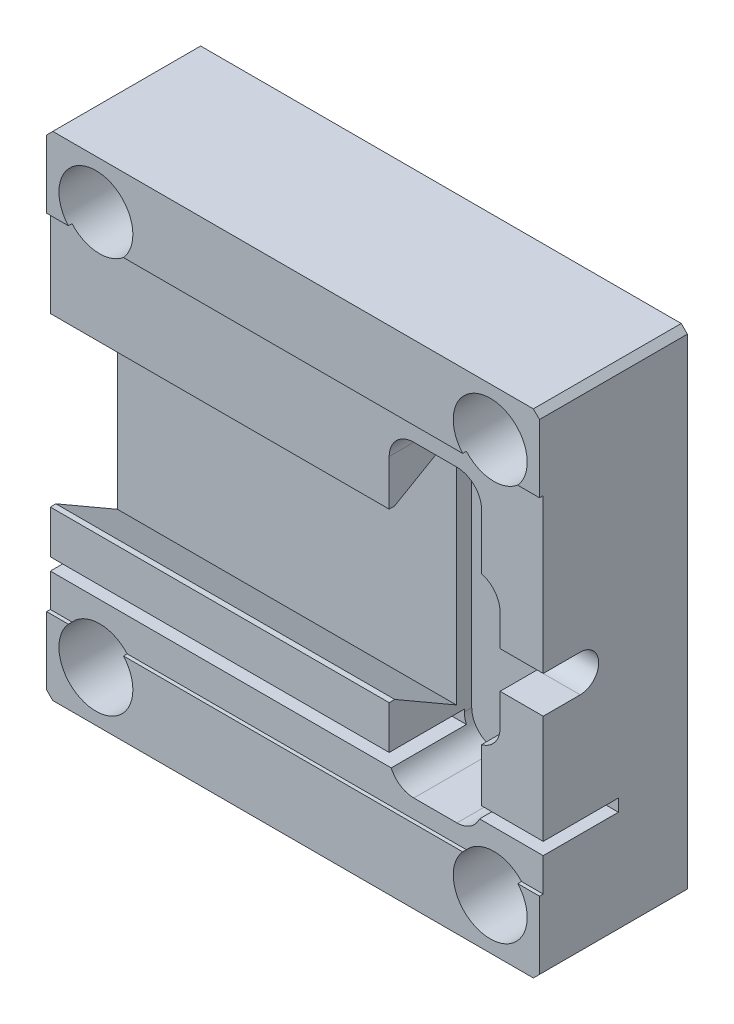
ISO-10303-21;
HEADER;
FILE_DESCRIPTION(('STEP AP214'),'2;1');
FILE_NAME('part.step','',(''),(''),'','','');
FILE_SCHEMA(('AUTOMOTIVE_DESIGN { 1 0 10303 214 1 1 1 1 }'));
ENDSEC;
DATA;
#1=APPLICATION_CONTEXT('core data for automotive mechanical design processes');
#2=APPLICATION_PROTOCOL_DEFINITION('international standard','automotive_design',2000,#1);
#3=PRODUCT_CONTEXT('',#1,'mechanical');
#4=PRODUCT('Part','Part','',(#3));
#5=PRODUCT_RELATED_PRODUCT_CATEGORY('part','',(#4));
#6=PRODUCT_DEFINITION_FORMATION('','',#4);
#7=PRODUCT_DEFINITION_CONTEXT('part definition',#1,'design');
#8=PRODUCT_DEFINITION('design','',#6,#7);
#9=PRODUCT_DEFINITION_SHAPE('','',#8);
#10=(LENGTH_UNIT() NAMED_UNIT(*) SI_UNIT(.MILLI.,.METRE.));
#11=(NAMED_UNIT(*) PLANE_ANGLE_UNIT() SI_UNIT($,.RADIAN.));
#12=(NAMED_UNIT(*) SI_UNIT($,.STERADIAN.) SOLID_ANGLE_UNIT());
#13=UNCERTAINTY_MEASURE_WITH_UNIT(LENGTH_MEASURE(1.E-05),#10,'distance_accuracy_value','');
#14=(GEOMETRIC_REPRESENTATION_CONTEXT(3) GLOBAL_UNCERTAINTY_ASSIGNED_CONTEXT((#13)) GLOBAL_UNIT_ASSIGNED_CONTEXT((#10,
#11,#12)) REPRESENTATION_CONTEXT('',''));
#15=CARTESIAN_POINT('',(0.,0.,0.));
#16=DIRECTION('',(0.,0.,1.));
#17=DIRECTION('',(1.,0.,0.));
#18=AXIS2_PLACEMENT_3D('',#15,#16,#17);
#19=CARTESIAN_POINT('',(20.0000000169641,-10.3000000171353,5.59999999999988));
#20=DIRECTION('',(5.71177977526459E-10,1.,0.));
#21=DIRECTION('',(-1.,5.71177977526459E-10,0.));
#22=AXIS2_PLACEMENT_3D('',#19,#20,#21);
#23=PLANE('',#22);
#24=DIRECTION('',(-1.,5.71177977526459E-10,0.));
#25=VECTOR('',#24,1.);
#26=CARTESIAN_POINT('',(20.0000000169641,-10.3000000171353,11.6999999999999));
#27=LINE('',#26,#25);
#28=CARTESIAN_POINT('',(7.4999999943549,-10.3000000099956,11.6999999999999));
#29=VERTEX_POINT('',#28);
#30=CARTESIAN_POINT('',(-20.0000000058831,-10.2999999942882,11.7));
#31=VERTEX_POINT('',#30);
#32=EDGE_CURVE('E486',#29,#31,#27,.T.);
#33=ORIENTED_EDGE('',*,*,#32,.T.);
#34=DIRECTION('',(0.,0.,-1.));
#35=VECTOR('',#34,1.);
#36=CARTESIAN_POINT('',(-20.0000000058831,-10.2999999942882,5.6));
#37=LINE('',#36,#35);
#38=CARTESIAN_POINT('',(-20.0000000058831,-10.2999999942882,5.6));
#39=VERTEX_POINT('',#38);
#40=EDGE_CURVE('E467',#31,#39,#37,.T.);
#41=ORIENTED_EDGE('',*,*,#40,.T.);
#42=DIRECTION('',(-1.,5.71177977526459E-10,0.));
#43=VECTOR('',#42,1.);
#44=CARTESIAN_POINT('',(20.0000000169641,-10.3000000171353,5.59999999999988));
#45=LINE('',#44,#43);
#46=CARTESIAN_POINT('',(7.4999999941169,-10.3000000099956,5.59999999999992));
#47=VERTEX_POINT('',#46);
#48=EDGE_CURVE('E483',#47,#39,#45,.T.);
#49=ORIENTED_EDGE('',*,*,#48,.F.);
#50=DIRECTION('',(0.,0.,-1.));
#51=VECTOR('',#50,1.);
#52=CARTESIAN_POINT('',(7.49999999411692,-10.3000000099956,18.4000000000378));
#53=LINE('',#52,#51);
#54=EDGE_CURVE('E499',#29,#47,#53,.T.);
#55=ORIENTED_EDGE('',*,*,#54,.F.);
#56=EDGE_LOOP('',(#33,#41,#49,#55));
#57=FACE_BOUND('',#56,.T.);
#58=CARTESIAN_POINT('',(-2.99999999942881,-10.3000000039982,8.99999999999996));
#59=DIRECTION('',(5.71177977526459E-10,1.,0.));
#60=DIRECTION('',(-1.,5.71177977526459E-10,0.));
#61=AXIS2_PLACEMENT_3D('',#58,#59,#60);
#62=CIRCLE('',#61,0.999999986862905);
#63=CARTESIAN_POINT('',(-3.99999998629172,-10.300000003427,8.99999999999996));
#64=VERTEX_POINT('',#63);
#65=EDGE_CURVE('E1087',#64,#64,#62,.F.);
#66=ORIENTED_EDGE('',*,*,#65,.F.);
#67=EDGE_LOOP('',(#66));
#68=FACE_BOUND('',#67,.T.);
#69=ADVANCED_FACE('F16',(#57,#68),#23,.F.);
#70=CARTESIAN_POINT('',(20.0000000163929,-11.3000000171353,5.59999999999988));
#71=DIRECTION('',(-5.71177977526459E-10,-1.,0.));
#72=DIRECTION('',(1.,-5.71177977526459E-10,0.));
#73=AXIS2_PLACEMENT_3D('',#70,#71,#72);
#74=PLANE('',#73);
#75=CARTESIAN_POINT('',(4.4999999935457,-11.3000000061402,8.99999999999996));
#76=DIRECTION('',(-5.71177977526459E-10,-1.,0.));
#77=DIRECTION('',(1.,-5.71177977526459E-10,0.));
#78=AXIS2_PLACEMENT_3D('',#75,#76,#77);
#79=CIRCLE('',#78,1.2295);
#80=CARTESIAN_POINT('',(5.7294999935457,-11.3000000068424,8.99999999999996));
#81=VERTEX_POINT('',#80);
#82=EDGE_CURVE('E554',#81,#81,#79,.T.);
#83=ORIENTED_EDGE('',*,*,#82,.T.);
#84=EDGE_LOOP('',(#83));
#85=FACE_BOUND('',#84,.T.);
#86=DIRECTION('',(-1.,5.71177977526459E-10,0.));
#87=VECTOR('',#86,1.);
#88=CARTESIAN_POINT('',(20.0000000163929,-11.3000000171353,5.59999999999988));
#89=LINE('',#88,#87);
#90=CARTESIAN_POINT('',(7.6669697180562,-11.300000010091,5.59999999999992));
#91=VERTEX_POINT('',#90);
#92=CARTESIAN_POINT('',(-20.0000000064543,-11.2999999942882,5.59999999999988));
#93=VERTEX_POINT('',#92);
#94=EDGE_CURVE('E473',#91,#93,#89,.T.);
#95=ORIENTED_EDGE('',*,*,#94,.T.);
#96=DIRECTION('',(0.,0.,1.));
#97=VECTOR('',#96,1.);
#98=CARTESIAN_POINT('',(-20.0000000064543,-11.2999999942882,5.6));
#99=LINE('',#98,#97);
#100=CARTESIAN_POINT('',(-20.0000000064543,-11.2999999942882,11.7));
#101=VERTEX_POINT('',#100);
#102=EDGE_CURVE('E475',#93,#101,#99,.T.);
#103=ORIENTED_EDGE('',*,*,#102,.T.);
#104=DIRECTION('',(-1.,5.71177977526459E-10,0.));
#105=VECTOR('',#104,1.);
#106=CARTESIAN_POINT('',(20.0000000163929,-11.3000000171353,11.6999999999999));
#107=LINE('',#106,#105);
#108=CARTESIAN_POINT('',(7.66696971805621,-11.300000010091,11.6999999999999));
#109=VERTEX_POINT('',#108);
#110=EDGE_CURVE('E490',#109,#101,#107,.T.);
#111=ORIENTED_EDGE('',*,*,#110,.F.);
#112=DIRECTION('',(0.,0.,-1.));
#113=VECTOR('',#112,1.);
#114=CARTESIAN_POINT('',(7.66696971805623,-11.300000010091,18.4000000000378));
#115=LINE('',#114,#113);
#116=EDGE_CURVE('E482',#91,#109,#115,.F.);
#117=ORIENTED_EDGE('',*,*,#116,.F.);
#118=EDGE_LOOP('',(#95,#103,#111,#117));
#119=FACE_BOUND('',#118,.T.);
#120=CARTESIAN_POINT('',(-10.5000000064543,-11.2999999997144,8.99999999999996));
#121=DIRECTION('',(-5.71177977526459E-10,-1.,0.));
#122=DIRECTION('',(1.,-5.71177977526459E-10,0.));
#123=AXIS2_PLACEMENT_3D('',#120,#121,#122);
#124=CIRCLE('',#123,1.2295);
#125=CARTESIAN_POINT('',(-9.2705000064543,-11.3000000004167,8.99999999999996));
#126=VERTEX_POINT('',#125);
#127=EDGE_CURVE('E459',#126,#126,#124,.T.);
#128=ORIENTED_EDGE('',*,*,#127,.T.);
#129=EDGE_LOOP('',(#128));
#130=FACE_BOUND('',#129,.T.);
#131=CARTESIAN_POINT('',(-2.99999999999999,-11.3000000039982,8.99999999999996));
#132=DIRECTION('',(-5.71177977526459E-10,-1.,0.));
#133=DIRECTION('',(1.,-5.71177977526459E-10,0.));
#134=AXIS2_PLACEMENT_3D('',#131,#132,#133);
#135=CIRCLE('',#134,1.5);
#136=CARTESIAN_POINT('',(-1.49999999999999,-11.300000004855,8.99999999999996));
#137=VERTEX_POINT('',#136);
#138=EDGE_CURVE('E842',#137,#137,#135,.F.);
#139=ORIENTED_EDGE('',*,*,#138,.F.);
#140=EDGE_LOOP('',(#139));
#141=FACE_BOUND('',#140,.T.);
#142=ADVANCED_FACE('F903',(#85,#119,#130,#141),#74,.F.);
#143=CARTESIAN_POINT('',(-3.00000001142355,-19.9999999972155,8.99999999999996));
#144=DIRECTION('',(-5.71177977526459E-10,-1.,0.));
#145=DIRECTION('',(1.,-5.71177977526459E-10,0.));
#146=AXIS2_PLACEMENT_3D('',#143,#144,#145);
#147=CYLINDRICAL_SURFACE('',#146,1.2295);
#148=CARTESIAN_POINT('',(-3.00000001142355,-19.9999999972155,8.99999999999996));
#149=DIRECTION('',(-5.71177977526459E-10,-1.,0.));
#150=DIRECTION('',(1.,-5.71177977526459E-10,0.));
#151=AXIS2_PLACEMENT_3D('',#148,#149,#150);
#152=CIRCLE('',#151,1.2295);
#153=CARTESIAN_POINT('',(-1.77050001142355,-19.9999999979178,8.99999999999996));
#154=VERTEX_POINT('',#153);
#155=EDGE_CURVE('E453',#154,#154,#152,.T.);
#156=ORIENTED_EDGE('',*,*,#155,.T.);
#157=EDGE_LOOP('',(#156));
#158=FACE_BOUND('',#157,.T.);
#159=CARTESIAN_POINT('',(-3.93350600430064,-19.9640000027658,8.19985200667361));
#160=CARTESIAN_POINT('',(-3.89388404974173,-19.9640000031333,8.15362799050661));
#161=CARTESIAN_POINT('',(-3.85081294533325,-19.9640000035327,8.1103415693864));
#162=CARTESIAN_POINT('',(-3.75871474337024,-19.9640000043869,8.03059907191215));
#163=CARTESIAN_POINT('',(-3.70968322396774,-19.9640000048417,7.99414811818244));
#164=CARTESIAN_POINT('',(-3.59983222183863,-19.9640000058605,7.92452633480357));
#165=CARTESIAN_POINT('',(-3.53831371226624,-19.964000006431,7.89245099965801));
#166=CARTESIAN_POINT('',(-3.41075877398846,-19.964000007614,7.83908201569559));
#167=CARTESIAN_POINT('',(-3.34472133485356,-19.9640000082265,7.81779078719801));
#168=CARTESIAN_POINT('',(-3.21001283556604,-19.9640000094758,7.78659842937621));
#169=CARTESIAN_POINT('',(-3.14134200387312,-19.9640000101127,7.77669631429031));
#170=CARTESIAN_POINT('',(-3.00331670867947,-19.9640000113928,7.7685623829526));
#171=CARTESIAN_POINT('',(-2.93396228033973,-19.9640000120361,7.77032996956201));
#172=CARTESIAN_POINT('',(-2.79653292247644,-19.9640000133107,7.78548342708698));
#173=CARTESIAN_POINT('',(-2.72845801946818,-19.964000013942,7.79886953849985));
#174=CARTESIAN_POINT('',(-2.59552114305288,-19.9640000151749,7.83688072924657));
#175=CARTESIAN_POINT('',(-2.53065920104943,-19.9640000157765,7.86150591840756));
#176=CARTESIAN_POINT('',(-2.40599043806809,-19.9640000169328,7.9212960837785));
#177=CARTESIAN_POINT('',(-2.34618359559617,-19.9640000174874,7.95646101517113));
#178=CARTESIAN_POINT('',(-2.23332254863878,-19.9640000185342,8.03633243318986));
#179=CARTESIAN_POINT('',(-2.1802683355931,-19.9640000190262,8.08103890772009));
#180=CARTESIAN_POINT('',(-2.08241847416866,-19.9640000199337,8.17872438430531));
#181=CARTESIAN_POINT('',(-2.03762283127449,-19.9640000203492,8.23170339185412));
#182=CARTESIAN_POINT('',(-1.95756177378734,-19.9640000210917,8.34442999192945));
#183=CARTESIAN_POINT('',(-1.92229635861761,-19.9640000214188,8.40417758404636));
#184=CARTESIAN_POINT('',(-1.86229683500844,-19.9640000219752,8.52874529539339));
#185=CARTESIAN_POINT('',(-1.83756272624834,-19.9640000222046,8.59356541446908));
#186=CARTESIAN_POINT('',(-1.79932794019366,-19.9640000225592,8.72643813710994));
#187=CARTESIAN_POINT('',(-1.78582726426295,-19.9640000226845,8.79449074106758));
#188=CARTESIAN_POINT('',(-1.7704425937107,-19.9640000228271,8.93189661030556));
#189=CARTESIAN_POINT('',(-1.76855859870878,-19.9640000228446,9.00124987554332));
#190=CARTESIAN_POINT('',(-1.77646076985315,-19.9640000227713,9.13928833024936));
#191=CARTESIAN_POINT('',(-1.7862469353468,-19.9640000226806,9.207973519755));
#192=CARTESIAN_POINT('',(-1.81721162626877,-19.9640000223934,9.34272605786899));
#193=CARTESIAN_POINT('',(-1.83839015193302,-19.964000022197,9.40879340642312));
#194=CARTESIAN_POINT('',(-1.89153836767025,-19.964000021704,9.5364348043));
#195=CARTESIAN_POINT('',(-1.92350805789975,-19.9640000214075,9.59800885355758));
#196=CARTESIAN_POINT('',(-1.99733107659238,-19.9640000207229,9.71491574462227));
#197=CARTESIAN_POINT('',(-2.03918440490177,-19.9640000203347,9.77024858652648));
#198=CARTESIAN_POINT('',(-2.13158660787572,-19.9640000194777,9.87310232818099));
#199=CARTESIAN_POINT('',(-2.18213548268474,-19.9640000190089,9.92062322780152));
#200=CARTESIAN_POINT('',(-2.29049384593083,-19.9640000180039,10.0065041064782));
#201=CARTESIAN_POINT('',(-2.34830333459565,-19.9640000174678,10.0448640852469));
#202=CARTESIAN_POINT('',(-2.46954187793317,-19.9640000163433,10.1113341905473));
#203=CARTESIAN_POINT('',(-2.53297093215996,-19.9640000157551,10.1394443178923));
#204=CARTESIAN_POINT('',(-2.66364804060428,-19.9640000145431,10.184616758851));
#205=CARTESIAN_POINT('',(-2.73089609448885,-19.9640000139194,10.2016790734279));
#206=CARTESIAN_POINT('',(-2.86730225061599,-19.9640000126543,10.2242715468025));
#207=CARTESIAN_POINT('',(-2.93646035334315,-19.9640000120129,10.2298017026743));
#208=CARTESIAN_POINT('',(-3.07472340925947,-19.9640000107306,10.2291728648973));
#209=CARTESIAN_POINT('',(-3.14382836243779,-19.9640000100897,10.2230138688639));
#210=CARTESIAN_POINT('',(-3.28002337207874,-19.9640000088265,10.1991815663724));
#211=CARTESIAN_POINT('',(-3.34711342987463,-19.9640000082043,10.1815082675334));
#212=CARTESIAN_POINT('',(-3.47737419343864,-19.9640000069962,10.1351490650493));
#213=CARTESIAN_POINT('',(-3.54054490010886,-19.9640000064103,10.1064631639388));
#214=CARTESIAN_POINT('',(-3.6611738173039,-19.9640000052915,10.0388930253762));
#215=CARTESIAN_POINT('',(-3.71863202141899,-19.9640000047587,10.000008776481));
#216=CARTESIAN_POINT('',(-3.82620471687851,-19.964000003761,9.91314582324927));
#217=CARTESIAN_POINT('',(-3.87631921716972,-19.9640000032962,9.86516712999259));
#218=CARTESIAN_POINT('',(-3.96778204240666,-19.9640000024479,9.76147715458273));
#219=CARTESIAN_POINT('',(-4.00913035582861,-19.9640000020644,9.70576586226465));
#220=CARTESIAN_POINT('',(-4.08188741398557,-19.9640000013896,9.58819154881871));
#221=CARTESIAN_POINT('',(-4.11329604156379,-19.9640000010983,9.52632845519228));
#222=CARTESIAN_POINT('',(-4.16528072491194,-19.9640000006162,9.39820873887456));
#223=CARTESIAN_POINT('',(-4.18585705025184,-19.9640000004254,9.33195222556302));
#224=CARTESIAN_POINT('',(-4.21559350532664,-19.9640000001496,9.19692993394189));
#225=CARTESIAN_POINT('',(-4.22475438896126,-19.9640000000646,9.12816432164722));
#226=CARTESIAN_POINT('',(-4.23140202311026,-19.964000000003,8.99005915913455));
#227=CARTESIAN_POINT('',(-4.22888694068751,-19.9640000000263,8.92071952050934));
#228=CARTESIAN_POINT('',(-4.21225084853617,-19.9640000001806,8.78343016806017));
#229=CARTESIAN_POINT('',(-4.19812634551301,-19.9640000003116,8.71548087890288));
#230=CARTESIAN_POINT('',(-4.1586699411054,-19.9640000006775,8.58295488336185));
#231=CARTESIAN_POINT('',(-4.13334655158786,-19.9640000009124,8.51837565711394));
#232=CARTESIAN_POINT('',(-4.08008806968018,-19.9640000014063,8.41031757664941));
#233=CARTESIAN_POINT('',(-4.05448466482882,-19.9640000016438,8.36567198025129));
#234=CARTESIAN_POINT('',(-3.99790676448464,-19.9640000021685,8.27993866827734));
#235=CARTESIAN_POINT('',(-3.96693390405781,-19.9640000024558,8.23884987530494));
#236=CARTESIAN_POINT('',(-3.93350600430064,-19.9640000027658,8.19985200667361));
#237=B_SPLINE_CURVE_WITH_KNOTS('',3,(#159,#160,#161,#162,#163,#164,#165,#166,#167,#168,#169,
#170,#171,#172,#173,#174,#175,#176,#177,#178,#179,#180,#181,#182,#183,#184,#185,#186,#187,#188,
#189,#190,#191,#192,#193,#194,#195,#196,#197,#198,#199,#200,#201,#202,#203,#204,#205,#206,#207,
#208,#209,#210,#211,#212,#213,#214,#215,#216,#217,#218,#219,#220,#221,#222,#223,#224,#225,#226,
#227,#228,#229,#230,#231,#232,#233,#234,#235,#236),.UNSPECIFIED.,.T.,.F.,(4,2,2,2,2,2,2,2,2,2,2,
2,2,2,2,2,2,2,2,2,2,2,2,2,2,2,2,2,2,2,2,2,2,2,2,2,2,2,4),(0.,0.182499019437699,
0.365134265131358,0.572262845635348,0.779437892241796,0.986595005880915,1.19374151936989,
1.40089232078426,1.60804514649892,1.81519709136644,2.02234877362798,2.22950059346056,
2.43665240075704,2.64380420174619,2.8509560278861,3.05810784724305,3.26525965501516,
3.47241146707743,3.67956328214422,3.88671509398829,4.09386690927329,4.30101873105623,
4.50817053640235,4.71532232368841,4.92247416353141,5.12962604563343,5.33677779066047,
5.54392948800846,5.75108141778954,5.95823309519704,6.1653850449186,6.37253943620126,
6.57968867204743,6.78682422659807,6.99399229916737,7.20122273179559,7.40829592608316,
7.5623119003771,7.71628105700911),.UNSPECIFIED.);
#238=CARTESIAN_POINT('',(-3.93350600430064,-19.9640000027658,8.19985200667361));
#239=VERTEX_POINT('',#238);
#240=EDGE_CURVE('E834',#239,#239,#237,.T.);
#241=ORIENTED_EDGE('',*,*,#240,.F.);
#242=EDGE_LOOP('',(#241));
#243=FACE_BOUND('',#242,.T.);
#244=ADVANCED_FACE('F844',(#158,#243),#147,.F.);
#245=CARTESIAN_POINT('',(20.0000000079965,13.9999999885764,11.7));
#246=DIRECTION('',(0.,0.,1.));
#247=DIRECTION('',(1.,0.,0.));
#248=AXIS2_PLACEMENT_3D('',#245,#246,#247);
#249=PLANE('',#248);
#250=ORIENTED_EDGE('',*,*,#32,.F.);
#251=DIRECTION('',(0.,1.,0.));
#252=VECTOR('',#251,1.);
#253=CARTESIAN_POINT('',(7.49999999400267,13.9999999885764,11.7));
#254=LINE('',#253,#252);
#255=CARTESIAN_POINT('',(7.49999999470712,-6.80000000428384,11.7));
#256=VERTEX_POINT('',#255);
#257=EDGE_CURVE('E638',#29,#256,#254,.T.);
#258=ORIENTED_EDGE('',*,*,#257,.T.);
#259=DIRECTION('',(1.,0.,0.));
#260=VECTOR('',#259,1.);
#261=CARTESIAN_POINT('',(20.0000000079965,-6.80000000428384,11.7));
#262=LINE('',#261,#260);
#263=CARTESIAN_POINT('',(-20.000000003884,-6.79999999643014,11.7));
#264=VERTEX_POINT('',#263);
#265=EDGE_CURVE('E640',#256,#264,#262,.F.);
#266=ORIENTED_EDGE('',*,*,#265,.T.);
#267=DIRECTION('',(-5.71177977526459E-10,-1.,0.));
#268=VECTOR('',#267,1.);
#269=CARTESIAN_POINT('',(-20.,1.14235595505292E-08,11.7));
#270=LINE('',#269,#268);
#271=EDGE_CURVE('E570',#31,#264,#270,.F.);
#272=ORIENTED_EDGE('',*,*,#271,.F.);
#273=EDGE_LOOP('',(#250,#258,#266,#272));
#274=FACE_BOUND('',#273,.T.);
#275=ADVANCED_FACE('F1150',(#274),#249,.T.);
#276=CARTESIAN_POINT('',(20.0000000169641,-10.3000000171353,11.6999999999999));
#277=VERTEX_POINT('',#276);
#278=CARTESIAN_POINT('',(14.9999999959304,-10.3000000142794,11.6999999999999));
#279=VERTEX_POINT('',#278);
#280=EDGE_CURVE('E484',#277,#279,#27,.T.);
#281=ORIENTED_EDGE('',*,*,#280,.F.);
#282=DIRECTION('',(5.71177977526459E-10,1.,0.));
#283=VECTOR('',#282,1.);
#284=CARTESIAN_POINT('',(20.,-1.14235595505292E-08,11.7));
#285=LINE('',#284,#283);
#286=CARTESIAN_POINT('',(19.9999999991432,-1.50000001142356,11.7));
#287=VERTEX_POINT('',#286);
#288=EDGE_CURVE('E664',#287,#277,#285,.F.);
#289=ORIENTED_EDGE('',*,*,#288,.F.);
#290=DIRECTION('',(1.,-5.71177977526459E-10,0.));
#291=VECTOR('',#290,1.);
#292=CARTESIAN_POINT('',(10.1746541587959,-1.50000000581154,11.7));
#293=LINE('',#292,#291);
#294=CARTESIAN_POINT('',(16.4999999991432,-1.50000000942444,11.7));
#295=VERTEX_POINT('',#294);
#296=EDGE_CURVE('E381',#295,#287,#293,.T.);
#297=ORIENTED_EDGE('',*,*,#296,.F.);
#298=DIRECTION('',(0.,1.,0.));
#299=VECTOR('',#298,1.);
#300=CARTESIAN_POINT('',(16.4999999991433,13.9999999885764,11.7));
#301=LINE('',#300,#299);
#302=CARTESIAN_POINT('',(16.4999999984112,-4.06350833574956,11.7));
#303=VERTEX_POINT('',#302);
#304=EDGE_CURVE('E650',#295,#303,#301,.F.);
#305=ORIENTED_EDGE('',*,*,#304,.T.);
#306=CARTESIAN_POINT('',(14.4999999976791,-4.06350833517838,11.7));
#307=DIRECTION('',(0.,0.,-1.));
#308=DIRECTION('',(-1.,0.,0.));
#309=AXIS2_PLACEMENT_3D('',#306,#307,#308);
#310=CIRCLE('',#309,2.);
#311=CARTESIAN_POINT('',(14.999999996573,-6.00000000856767,11.7));
#312=VERTEX_POINT('',#311);
#313=EDGE_CURVE('E649',#303,#312,#310,.T.);
#314=ORIENTED_EDGE('',*,*,#313,.T.);
#315=DIRECTION('',(0.,1.,0.));
#316=VECTOR('',#315,1.);
#317=CARTESIAN_POINT('',(14.999999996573,13.9999999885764,11.7));
#318=LINE('',#317,#316);
#319=EDGE_CURVE('E646',#312,#279,#318,.F.);
#320=ORIENTED_EDGE('',*,*,#319,.T.);
#321=EDGE_LOOP('',(#281,#289,#297,#305,#314,#320));
#322=FACE_BOUND('',#321,.T.);
#323=ADVANCED_FACE('F934',(#322),#249,.T.);
#324=CARTESIAN_POINT('',(14.9999999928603,-12.5000000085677,5.));
#325=DIRECTION('',(0.,0.,-1.));
#326=DIRECTION('',(-1.,0.,0.));
#327=AXIS2_PLACEMENT_3D('',#324,#325,#326);
#328=PLANE('',#327);
#329=CARTESIAN_POINT('',(13.0000000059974,10.4999999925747,5.));
#330=DIRECTION('',(0.,0.,-1.));
#331=DIRECTION('',(-1.,0.,0.));
#332=AXIS2_PLACEMENT_3D('',#329,#330,#331);
#333=CIRCLE('',#332,2.);
#334=CARTESIAN_POINT('',(15.0000000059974,10.4999999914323,5.));
#335=VERTEX_POINT('',#334);
#336=CARTESIAN_POINT('',(13.0000000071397,12.4999999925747,5.));
#337=VERTEX_POINT('',#336);
#338=EDGE_CURVE('E719',#335,#337,#333,.F.);
#339=ORIENTED_EDGE('',*,*,#338,.T.);
#340=DIRECTION('',(-1.,5.71177977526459E-10,0.));
#341=VECTOR('',#340,1.);
#342=CARTESIAN_POINT('',(7.50000000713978,12.4999999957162,5.));
#343=LINE('',#342,#341);
#344=CARTESIAN_POINT('',(9.50000000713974,12.4999999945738,5.));
#345=VERTEX_POINT('',#344);
#346=EDGE_CURVE('E722',#337,#345,#343,.T.);
#347=ORIENTED_EDGE('',*,*,#346,.T.);
#348=CARTESIAN_POINT('',(9.50000000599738,10.4999999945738,5.));
#349=DIRECTION('',(0.,0.,-1.));
#350=DIRECTION('',(-1.,0.,0.));
#351=AXIS2_PLACEMENT_3D('',#348,#349,#350);
#352=CIRCLE('',#351,2.);
#353=CARTESIAN_POINT('',(7.50000000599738,10.499999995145,5.));
#354=VERTEX_POINT('',#353);
#355=EDGE_CURVE('E725',#345,#354,#352,.F.);
#356=ORIENTED_EDGE('',*,*,#355,.T.);
#357=DIRECTION('',(-5.71177977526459E-10,-1.,0.));
#358=VECTOR('',#357,1.);
#359=CARTESIAN_POINT('',(7.49999999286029,-12.5000000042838,5.));
#360=LINE('',#359,#358);
#361=CARTESIAN_POINT('',(7.49999999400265,-10.5000000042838,5.));
#362=VERTEX_POINT('',#361);
#363=EDGE_CURVE('E728',#354,#362,#360,.T.);
#364=ORIENTED_EDGE('',*,*,#363,.T.);
#365=CARTESIAN_POINT('',(9.49999999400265,-10.5000000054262,5.));
#366=DIRECTION('',(0.,0.,-1.));
#367=DIRECTION('',(-1.,0.,0.));
#368=AXIS2_PLACEMENT_3D('',#365,#366,#367);
#369=CIRCLE('',#368,2.);
#370=CARTESIAN_POINT('',(9.4999999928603,-12.5000000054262,5.));
#371=VERTEX_POINT('',#370);
#372=EDGE_CURVE('E744',#362,#371,#369,.F.);
#373=ORIENTED_EDGE('',*,*,#372,.T.);
#374=DIRECTION('',(1.,-5.71177977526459E-10,0.));
#375=VECTOR('',#374,1.);
#376=CARTESIAN_POINT('',(14.9999999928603,-12.5000000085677,5.));
#377=LINE('',#376,#375);
#378=CARTESIAN_POINT('',(12.9999999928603,-12.5000000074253,5.));
#379=VERTEX_POINT('',#378);
#380=EDGE_CURVE('E748',#371,#379,#377,.T.);
#381=ORIENTED_EDGE('',*,*,#380,.T.);
#382=CARTESIAN_POINT('',(12.9999999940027,-10.5000000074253,5.));
#383=DIRECTION('',(0.,0.,-1.));
#384=DIRECTION('',(-1.,0.,0.));
#385=AXIS2_PLACEMENT_3D('',#382,#383,#384);
#386=CIRCLE('',#385,2.);
#387=CARTESIAN_POINT('',(14.9999999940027,-10.5000000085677,5.));
#388=VERTEX_POINT('',#387);
#389=EDGE_CURVE('E752',#379,#388,#386,.F.);
#390=ORIENTED_EDGE('',*,*,#389,.T.);
#391=DIRECTION('',(5.71177977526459E-10,1.,0.));
#392=VECTOR('',#391,1.);
#393=CARTESIAN_POINT('',(14.999999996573,-6.00000000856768,5.));
#394=LINE('',#393,#392);
#395=CARTESIAN_POINT('',(14.999999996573,-6.00000000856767,5.));
#396=VERTEX_POINT('',#395);
#397=EDGE_CURVE('E755',#388,#396,#394,.T.);
#398=ORIENTED_EDGE('',*,*,#397,.T.);
#399=CARTESIAN_POINT('',(14.4999999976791,-4.06350833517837,5.));
#400=DIRECTION('',(0.,0.,-1.));
#401=DIRECTION('',(-1.,0.,0.));
#402=AXIS2_PLACEMENT_3D('',#399,#400,#401);
#403=CIRCLE('',#402,2.);
#404=CARTESIAN_POINT('',(16.499999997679,-4.06350833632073,5.));
#405=VERTEX_POINT('',#404);
#406=EDGE_CURVE('E543',#396,#405,#403,.F.);
#407=ORIENTED_EDGE('',*,*,#406,.T.);
#408=DIRECTION('',(5.71177977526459E-10,1.,0.));
#409=VECTOR('',#408,1.);
#410=CARTESIAN_POINT('',(16.5000000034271,5.99999999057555,5.));
#411=LINE('',#410,#409);
#412=CARTESIAN_POINT('',(16.500000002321,4.06350831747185,5.));
#413=VERTEX_POINT('',#412);
#414=EDGE_CURVE('E709',#405,#413,#411,.T.);
#415=ORIENTED_EDGE('',*,*,#414,.T.);
#416=CARTESIAN_POINT('',(14.500000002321,4.06350831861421,5.));
#417=DIRECTION('',(0.,0.,1.));
#418=DIRECTION('',(1.,0.,0.));
#419=AXIS2_PLACEMENT_3D('',#416,#417,#418);
#420=CIRCLE('',#419,2.);
#421=CARTESIAN_POINT('',(15.0000000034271,5.99999999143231,5.));
#422=VERTEX_POINT('',#421);
#423=EDGE_CURVE('E713',#413,#422,#420,.T.);
#424=ORIENTED_EDGE('',*,*,#423,.T.);
#425=DIRECTION('',(5.71177977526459E-10,1.,0.));
#426=VECTOR('',#425,1.);
#427=CARTESIAN_POINT('',(15.0000000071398,12.4999999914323,5.));
#428=LINE('',#427,#426);
#429=EDGE_CURVE('E716',#422,#335,#428,.T.);
#430=ORIENTED_EDGE('',*,*,#429,.T.);
#431=EDGE_LOOP('',(#339,#347,#356,#364,#373,#381,#390,#398,#407,#415,#424,#430));
#432=FACE_BOUND('',#431,.T.);
#433=ADVANCED_FACE('F951',(#432),#328,.F.);
#434=CARTESIAN_POINT('',(14.4999999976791,-4.06350833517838,18.4000000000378));
#435=DIRECTION('',(0.,0.,-1.));
#436=DIRECTION('',(-1.,0.,0.));
#437=AXIS2_PLACEMENT_3D('',#434,#435,#436);
#438=CYLINDRICAL_SURFACE('',#437,2.);
#439=DIRECTION('',(0.,0.,1.));
#440=VECTOR('',#439,1.);
#441=CARTESIAN_POINT('',(16.499999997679,-4.06350833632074,18.4000000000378));
#442=LINE('',#441,#440);
#443=EDGE_CURVE('E712',#303,#405,#442,.F.);
#444=ORIENTED_EDGE('',*,*,#443,.T.);
#445=ORIENTED_EDGE('',*,*,#406,.F.);
#446=DIRECTION('',(0.,0.,1.));
#447=VECTOR('',#446,1.);
#448=CARTESIAN_POINT('',(14.999999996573,-6.00000000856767,18.4000000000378));
#449=LINE('',#448,#447);
#450=EDGE_CURVE('E753',#396,#312,#449,.T.);
#451=ORIENTED_EDGE('',*,*,#450,.T.);
#452=ORIENTED_EDGE('',*,*,#313,.F.);
#453=EDGE_LOOP('',(#444,#445,#451,#452));
#454=FACE_BOUND('',#453,.T.);
#455=ADVANCED_FACE('F998',(#454),#438,.F.);
#456=CARTESIAN_POINT('',(14.999999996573,-6.00000000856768,18.4000000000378));
#457=DIRECTION('',(1.,-5.71177977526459E-10,0.));
#458=DIRECTION('',(5.71177977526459E-10,1.,0.));
#459=AXIS2_PLACEMENT_3D('',#456,#457,#458);
#460=PLANE('',#459);
#461=DIRECTION('',(0.,0.,-1.));
#462=VECTOR('',#461,1.);
#463=CARTESIAN_POINT('',(14.9999999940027,-10.5000000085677,18.4000000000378));
#464=LINE('',#463,#462);
#465=CARTESIAN_POINT('',(14.9999999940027,-10.5000000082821,5.5999999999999));
#466=VERTEX_POINT('',#465);
#467=EDGE_CURVE('E749',#388,#466,#464,.F.);
#468=ORIENTED_EDGE('',*,*,#467,.T.);
#469=DIRECTION('',(5.71177977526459E-10,1.,0.));
#470=VECTOR('',#469,1.);
#471=CARTESIAN_POINT('',(14.999999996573,-6.00000000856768,5.5999999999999));
#472=LINE('',#471,#470);
#473=CARTESIAN_POINT('',(14.9999999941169,-10.3000000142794,5.5999999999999));
#474=VERTEX_POINT('',#473);
#475=EDGE_CURVE('E514',#466,#474,#472,.T.);
#476=ORIENTED_EDGE('',*,*,#475,.T.);
#477=DIRECTION('',(0.,0.,1.));
#478=VECTOR('',#477,1.);
#479=CARTESIAN_POINT('',(14.9999999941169,-10.3000000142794,18.4000000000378));
#480=LINE('',#479,#478);
#481=EDGE_CURVE('E502',#474,#279,#480,.T.);
#482=ORIENTED_EDGE('',*,*,#481,.T.);
#483=ORIENTED_EDGE('',*,*,#319,.F.);
#484=ORIENTED_EDGE('',*,*,#450,.F.);
#485=ORIENTED_EDGE('',*,*,#397,.F.);
#486=EDGE_LOOP('',(#468,#476,#482,#483,#484,#485));
#487=FACE_BOUND('',#486,.T.);
#488=ADVANCED_FACE('F994',(#487),#460,.F.);
#489=CARTESIAN_POINT('',(12.9999999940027,-10.5000000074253,18.4000000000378));
#490=DIRECTION('',(0.,0.,-1.));
#491=DIRECTION('',(-1.,0.,0.));
#492=AXIS2_PLACEMENT_3D('',#489,#490,#491);
#493=CYLINDRICAL_SURFACE('',#492,2.);
#494=DIRECTION('',(0.,0.,-1.));
#495=VECTOR('',#494,1.);
#496=CARTESIAN_POINT('',(14.8330302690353,-11.3000000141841,18.4000000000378));
#497=LINE('',#496,#495);
#498=CARTESIAN_POINT('',(14.8330302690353,-11.3000000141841,11.6999999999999));
#499=VERTEX_POINT('',#498);
#500=CARTESIAN_POINT('',(14.8330302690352,-11.3000000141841,5.5999999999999));
#501=VERTEX_POINT('',#500);
#502=EDGE_CURVE('E496',#499,#501,#497,.T.);
#503=ORIENTED_EDGE('',*,*,#502,.T.);
#504=CARTESIAN_POINT('',(12.9999999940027,-10.5000000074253,5.59999999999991));
#505=DIRECTION('',(0.,0.,-1.));
#506=DIRECTION('',(-1.,0.,0.));
#507=AXIS2_PLACEMENT_3D('',#504,#505,#506);
#508=CIRCLE('',#507,2.);
#509=EDGE_CURVE('E511',#501,#466,#508,.F.);
#510=ORIENTED_EDGE('',*,*,#509,.T.);
#511=ORIENTED_EDGE('',*,*,#467,.F.);
#512=ORIENTED_EDGE('',*,*,#389,.F.);
#513=DIRECTION('',(0.,0.,1.));
#514=VECTOR('',#513,1.);
#515=CARTESIAN_POINT('',(12.9999999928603,-12.5000000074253,18.4000000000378));
#516=LINE('',#515,#514);
#517=CARTESIAN_POINT('',(12.9999999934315,-12.5000000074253,11.7));
#518=VERTEX_POINT('',#517);
#519=EDGE_CURVE('E745',#379,#518,#516,.T.);
#520=ORIENTED_EDGE('',*,*,#519,.T.);
#521=CARTESIAN_POINT('',(12.9999999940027,-10.5000000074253,11.7));
#522=DIRECTION('',(0.,0.,-1.));
#523=DIRECTION('',(-1.,0.,0.));
#524=AXIS2_PLACEMENT_3D('',#521,#522,#523);
#525=CIRCLE('',#524,2.);
#526=EDGE_CURVE('E645',#499,#518,#525,.T.);
#527=ORIENTED_EDGE('',*,*,#526,.F.);
#528=EDGE_LOOP('',(#503,#510,#511,#512,#520,#527));
#529=FACE_BOUND('',#528,.T.);
#530=ADVANCED_FACE('F988',(#529),#493,.F.);
#531=CARTESIAN_POINT('',(14.9999999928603,-12.5000000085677,18.4000000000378));
#532=DIRECTION('',(-5.71177977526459E-10,-1.,0.));
#533=DIRECTION('',(1.,-5.71177977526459E-10,0.));
#534=AXIS2_PLACEMENT_3D('',#531,#532,#533);
#535=PLANE('',#534);
#536=ORIENTED_EDGE('',*,*,#519,.F.);
#537=ORIENTED_EDGE('',*,*,#380,.F.);
#538=DIRECTION('',(0.,0.,-1.));
#539=VECTOR('',#538,1.);
#540=CARTESIAN_POINT('',(9.49999999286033,-12.5000000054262,18.4000000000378));
#541=LINE('',#540,#539);
#542=CARTESIAN_POINT('',(9.49999999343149,-12.5000000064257,11.7));
#543=VERTEX_POINT('',#542);
#544=EDGE_CURVE('E741',#371,#543,#541,.F.);
#545=ORIENTED_EDGE('',*,*,#544,.T.);
#546=DIRECTION('',(1.,0.,0.));
#547=VECTOR('',#546,1.);
#548=CARTESIAN_POINT('',(20.0000000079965,-12.5000000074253,11.7));
#549=LINE('',#548,#547);
#550=EDGE_CURVE('E642',#518,#543,#549,.F.);
#551=ORIENTED_EDGE('',*,*,#550,.F.);
#552=EDGE_LOOP('',(#536,#537,#545,#551));
#553=FACE_BOUND('',#552,.T.);
#554=ADVANCED_FACE('F984',(#553),#535,.F.);
#555=CARTESIAN_POINT('',(9.49999999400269,-10.5000000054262,18.4000000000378));
#556=DIRECTION('',(0.,0.,-1.));
#557=DIRECTION('',(-1.,0.,0.));
#558=AXIS2_PLACEMENT_3D('',#555,#556,#557);
#559=CYLINDRICAL_SURFACE('',#558,2.);
#560=DIRECTION('',(0.,0.,1.));
#561=VECTOR('',#560,1.);
#562=CARTESIAN_POINT('',(7.49999999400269,-10.5000000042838,18.4000000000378));
#563=LINE('',#562,#561);
#564=CARTESIAN_POINT('',(7.49999999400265,-10.500000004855,5.59999999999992));
#565=VERTEX_POINT('',#564);
#566=EDGE_CURVE('E738',#362,#565,#563,.T.);
#567=ORIENTED_EDGE('',*,*,#566,.T.);
#568=CARTESIAN_POINT('',(9.49999999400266,-10.5000000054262,5.59999999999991));
#569=DIRECTION('',(0.,0.,-1.));
#570=DIRECTION('',(-1.,0.,0.));
#571=AXIS2_PLACEMENT_3D('',#568,#569,#570);
#572=CIRCLE('',#571,2.);
#573=EDGE_CURVE('E508',#565,#91,#572,.F.);
#574=ORIENTED_EDGE('',*,*,#573,.T.);
#575=ORIENTED_EDGE('',*,*,#116,.T.);
#576=CARTESIAN_POINT('',(9.49999999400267,-10.5000000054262,11.7));
#577=DIRECTION('',(0.,0.,-1.));
#578=DIRECTION('',(-1.,0.,0.));
#579=AXIS2_PLACEMENT_3D('',#576,#577,#578);
#580=CIRCLE('',#579,2.);
#581=EDGE_CURVE('E641',#543,#109,#580,.T.);
#582=ORIENTED_EDGE('',*,*,#581,.F.);
#583=ORIENTED_EDGE('',*,*,#544,.F.);
#584=ORIENTED_EDGE('',*,*,#372,.F.);
#585=EDGE_LOOP('',(#567,#574,#575,#582,#583,#584));
#586=FACE_BOUND('',#585,.T.);
#587=ADVANCED_FACE('F977',(#586),#559,.F.);
#588=CARTESIAN_POINT('',(-20.000010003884,-6.79999998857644,11.2454105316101));
#589=DIRECTION('',(5.71177977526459E-10,1.,0.));
#590=DIRECTION('',(-1.,5.71177977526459E-10,0.));
#591=AXIS2_PLACEMENT_3D('',#588,#589,#590);
#592=PLANE('',#591);
#593=DIRECTION('',(0.,0.,1.));
#594=VECTOR('',#593,1.);
#595=CARTESIAN_POINT('',(-20.000000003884,-6.79999998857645,11.2454105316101));
#596=LINE('',#595,#594);
#597=CARTESIAN_POINT('',(-20.000000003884,-6.79999998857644,11.2454105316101));
#598=VERTEX_POINT('',#597);
#599=EDGE_CURVE('E743',#598,#264,#596,.T.);
#600=ORIENTED_EDGE('',*,*,#599,.T.);
#601=ORIENTED_EDGE('',*,*,#265,.F.);
#602=DIRECTION('',(0.,0.,1.));
#603=VECTOR('',#602,1.);
#604=CARTESIAN_POINT('',(7.49999999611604,-6.80000000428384,18.4000000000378));
#605=LINE('',#604,#603);
#606=CARTESIAN_POINT('',(7.49999999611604,-6.80000000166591,11.2454105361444));
#607=VERTEX_POINT('',#606);
#608=EDGE_CURVE('E729',#256,#607,#605,.F.);
#609=ORIENTED_EDGE('',*,*,#608,.T.);
#610=DIRECTION('',(1.,-4.28382243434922E-10,2.47326603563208E-10));
#611=VECTOR('',#610,1.);
#612=CARTESIAN_POINT('',(-20.0000100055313,-6.79999998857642,11.2454105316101));
#613=LINE('',#612,#611);
#614=EDGE_CURVE('E634',#598,#607,#613,.T.);
#615=ORIENTED_EDGE('',*,*,#614,.F.);
#616=EDGE_LOOP('',(#600,#601,#609,#615));
#617=FACE_BOUND('',#616,.T.);
#618=ADVANCED_FACE('F1145',(#617),#592,.T.);
#619=CARTESIAN_POINT('',(-20.000009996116,6.80000001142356,11.7));
#620=DIRECTION('',(-5.71177977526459E-10,-1.,0.));
#621=DIRECTION('',(1.,-5.71177977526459E-10,0.));
#622=AXIS2_PLACEMENT_3D('',#619,#620,#621);
#623=PLANE('',#622);
#624=DIRECTION('',(0.,0.,-1.));
#625=VECTOR('',#624,1.);
#626=CARTESIAN_POINT('',(-19.9999999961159,6.80000001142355,11.7));
#627=LINE('',#626,#625);
#628=CARTESIAN_POINT('',(-19.9999999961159,6.80000001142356,11.7));
#629=VERTEX_POINT('',#628);
#630=CARTESIAN_POINT('',(-19.9999999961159,6.80000000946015,11.2627310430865));
#631=VERTEX_POINT('',#630);
#632=EDGE_CURVE('E737',#629,#631,#627,.T.);
#633=ORIENTED_EDGE('',*,*,#632,.T.);
#634=DIRECTION('',(1.,-4.28384722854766E-10,-2.47328035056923E-10));
#635=VECTOR('',#634,1.);
#636=CARTESIAN_POINT('',(-20.000009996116,6.80000000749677,11.2627310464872));
#637=LINE('',#636,#635);
#638=CARTESIAN_POINT('',(7.50000000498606,6.79999999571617,11.2627310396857));
#639=VERTEX_POINT('',#638);
#640=EDGE_CURVE('E623',#639,#631,#637,.F.);
#641=ORIENTED_EDGE('',*,*,#640,.F.);
#642=DIRECTION('',(0.,0.,1.));
#643=VECTOR('',#642,1.);
#644=CARTESIAN_POINT('',(7.50000000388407,6.79999999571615,18.4000000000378));
#645=LINE('',#644,#643);
#646=CARTESIAN_POINT('',(7.50000000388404,6.80000000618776,11.7));
#647=VERTEX_POINT('',#646);
#648=EDGE_CURVE('E726',#639,#647,#645,.T.);
#649=ORIENTED_EDGE('',*,*,#648,.T.);
#650=DIRECTION('',(1.,0.,0.));
#651=VECTOR('',#650,1.);
#652=CARTESIAN_POINT('',(20.0000000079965,6.80000001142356,11.7));
#653=LINE('',#652,#651);
#654=EDGE_CURVE('E616',#629,#647,#653,.T.);
#655=ORIENTED_EDGE('',*,*,#654,.F.);
#656=EDGE_LOOP('',(#633,#641,#649,#655));
#657=FACE_BOUND('',#656,.T.);
#658=ADVANCED_FACE('F1132',(#657),#623,.T.);
#659=CARTESIAN_POINT('',(7.49999999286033,-12.5000000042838,18.4000000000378));
#660=DIRECTION('',(-1.,5.71177977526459E-10,0.));
#661=DIRECTION('',(-5.71177977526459E-10,-1.,0.));
#662=AXIS2_PLACEMENT_3D('',#659,#660,#661);
#663=PLANE('',#662);
#664=ORIENTED_EDGE('',*,*,#54,.T.);
#665=DIRECTION('',(-5.71177977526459E-10,-1.,0.));
#666=VECTOR('',#665,1.);
#667=CARTESIAN_POINT('',(7.49999999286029,-12.5000000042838,5.59999999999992));
#668=LINE('',#667,#666);
#669=EDGE_CURVE('E505',#47,#565,#668,.T.);
#670=ORIENTED_EDGE('',*,*,#669,.T.);
#671=ORIENTED_EDGE('',*,*,#566,.F.);
#672=ORIENTED_EDGE('',*,*,#363,.F.);
#673=DIRECTION('',(0.,0.,-1.));
#674=VECTOR('',#673,1.);
#675=CARTESIAN_POINT('',(7.50000000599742,10.4999999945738,18.4000000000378));
#676=LINE('',#675,#674);
#677=CARTESIAN_POINT('',(7.50000000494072,10.4999999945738,11.7));
#678=VERTEX_POINT('',#677);
#679=EDGE_CURVE('E723',#354,#678,#676,.F.);
#680=ORIENTED_EDGE('',*,*,#679,.T.);
#681=DIRECTION('',(0.,1.,0.));
#682=VECTOR('',#681,1.);
#683=CARTESIAN_POINT('',(7.50000000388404,13.9999999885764,11.7));
#684=LINE('',#683,#682);
#685=EDGE_CURVE('E613',#647,#678,#684,.T.);
#686=ORIENTED_EDGE('',*,*,#685,.F.);
#687=ORIENTED_EDGE('',*,*,#648,.F.);
#688=DIRECTION('',(0.,0.5,-0.866025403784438));
#689=VECTOR('',#688,1.);
#690=CARTESIAN_POINT('',(7.50000000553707,6.799999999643,11.2627310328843));
#691=LINE('',#690,#689);
#692=CARTESIAN_POINT('',(7.5000000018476,9.69410161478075,6.24999999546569));
#693=VERTEX_POINT('',#692);
#694=EDGE_CURVE('E627',#693,#639,#691,.F.);
#695=ORIENTED_EDGE('',*,*,#694,.F.);
#696=DIRECTION('',(0.,1.,0.));
#697=VECTOR('',#696,1.);
#698=CARTESIAN_POINT('',(7.49999999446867,9.69410162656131,6.25));
#699=LINE('',#698,#697);
#700=CARTESIAN_POINT('',(7.49999999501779,-9.68410160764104,6.25000000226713));
#701=VERTEX_POINT('',#700);
#702=EDGE_CURVE('E633',#701,#693,#699,.T.);
#703=ORIENTED_EDGE('',*,*,#702,.F.);
#704=DIRECTION('',(0.,0.5,0.866025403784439));
#705=VECTOR('',#704,1.);
#706=CARTESIAN_POINT('',(7.49999999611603,-9.6841016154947,6.25000000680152));
#707=LINE('',#706,#705);
#708=EDGE_CURVE('E637',#607,#701,#707,.F.);
#709=ORIENTED_EDGE('',*,*,#708,.F.);
#710=ORIENTED_EDGE('',*,*,#608,.F.);
#711=ORIENTED_EDGE('',*,*,#257,.F.);
#712=EDGE_LOOP('',(#664,#670,#671,#672,#680,#686,#687,#695,#703,#709,#710,#711));
#713=FACE_BOUND('',#712,.T.);
#714=ADVANCED_FACE('F974',(#713),#663,.F.);
#715=CARTESIAN_POINT('',(9.50000000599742,10.4999999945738,18.4000000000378));
#716=DIRECTION('',(0.,0.,-1.));
#717=DIRECTION('',(-1.,0.,0.));
#718=AXIS2_PLACEMENT_3D('',#715,#716,#717);
#719=CYLINDRICAL_SURFACE('',#718,2.);
#720=ORIENTED_EDGE('',*,*,#679,.F.);
#721=ORIENTED_EDGE('',*,*,#355,.F.);
#722=DIRECTION('',(0.,0.,1.));
#723=VECTOR('',#722,1.);
#724=CARTESIAN_POINT('',(9.50000000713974,12.4999999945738,18.4000000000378));
#725=LINE('',#724,#723);
#726=CARTESIAN_POINT('',(9.50000000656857,12.4999999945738,11.7));
#727=VERTEX_POINT('',#726);
#728=EDGE_CURVE('E720',#345,#727,#725,.T.);
#729=ORIENTED_EDGE('',*,*,#728,.T.);
#730=CARTESIAN_POINT('',(9.5000000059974,10.4999999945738,11.7));
#731=DIRECTION('',(0.,0.,-1.));
#732=DIRECTION('',(-1.,0.,0.));
#733=AXIS2_PLACEMENT_3D('',#730,#731,#732);
#734=CIRCLE('',#733,2.);
#735=EDGE_CURVE('E612',#678,#727,#734,.T.);
#736=ORIENTED_EDGE('',*,*,#735,.F.);
#737=EDGE_LOOP('',(#720,#721,#729,#736));
#738=FACE_BOUND('',#737,.T.);
#739=ADVANCED_FACE('F969',(#738),#719,.F.);
#740=CARTESIAN_POINT('',(7.50000000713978,12.4999999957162,18.4000000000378));
#741=DIRECTION('',(5.71177977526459E-10,1.,0.));
#742=DIRECTION('',(-1.,5.71177977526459E-10,0.));
#743=AXIS2_PLACEMENT_3D('',#740,#741,#742);
#744=PLANE('',#743);
#745=DIRECTION('',(0.,0.,-1.));
#746=VECTOR('',#745,1.);
#747=CARTESIAN_POINT('',(13.0000000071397,12.4999999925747,18.4000000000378));
#748=LINE('',#747,#746);
#749=CARTESIAN_POINT('',(13.0000000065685,12.4999999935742,11.7));
#750=VERTEX_POINT('',#749);
#751=EDGE_CURVE('E717',#337,#750,#748,.F.);
#752=ORIENTED_EDGE('',*,*,#751,.T.);
#753=DIRECTION('',(1.,0.,0.));
#754=VECTOR('',#753,1.);
#755=CARTESIAN_POINT('',(20.0000000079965,12.4999999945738,11.7));
#756=LINE('',#755,#754);
#757=EDGE_CURVE('E609',#727,#750,#756,.T.);
#758=ORIENTED_EDGE('',*,*,#757,.F.);
#759=ORIENTED_EDGE('',*,*,#728,.F.);
#760=ORIENTED_EDGE('',*,*,#346,.F.);
#761=EDGE_LOOP('',(#752,#758,#759,#760));
#762=FACE_BOUND('',#761,.T.);
#763=ADVANCED_FACE('F964',(#762),#744,.F.);
#764=CARTESIAN_POINT('',(13.0000000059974,10.4999999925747,18.4000000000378));
#765=DIRECTION('',(0.,0.,-1.));
#766=DIRECTION('',(-1.,0.,0.));
#767=AXIS2_PLACEMENT_3D('',#764,#765,#766);
#768=CYLINDRICAL_SURFACE('',#767,2.);
#769=ORIENTED_EDGE('',*,*,#751,.F.);
#770=ORIENTED_EDGE('',*,*,#338,.F.);
#771=DIRECTION('',(0.,0.,1.));
#772=VECTOR('',#771,1.);
#773=CARTESIAN_POINT('',(15.0000000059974,10.4999999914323,18.4000000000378));
#774=LINE('',#773,#772);
#775=CARTESIAN_POINT('',(15.0000000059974,10.4999999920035,11.7));
#776=VERTEX_POINT('',#775);
#777=EDGE_CURVE('E714',#335,#776,#774,.T.);
#778=ORIENTED_EDGE('',*,*,#777,.T.);
#779=CARTESIAN_POINT('',(13.0000000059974,10.4999999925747,11.7));
#780=DIRECTION('',(0.,0.,-1.));
#781=DIRECTION('',(-1.,0.,0.));
#782=AXIS2_PLACEMENT_3D('',#779,#780,#781);
#783=CIRCLE('',#782,2.);
#784=EDGE_CURVE('E608',#750,#776,#783,.T.);
#785=ORIENTED_EDGE('',*,*,#784,.F.);
#786=EDGE_LOOP('',(#769,#770,#778,#785));
#787=FACE_BOUND('',#786,.T.);
#788=ADVANCED_FACE('F960',(#787),#768,.F.);
#789=CARTESIAN_POINT('',(15.0000000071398,12.4999999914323,18.4000000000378));
#790=DIRECTION('',(1.,-5.71177977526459E-10,0.));
#791=DIRECTION('',(5.71177977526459E-10,1.,0.));
#792=AXIS2_PLACEMENT_3D('',#789,#790,#791);
#793=PLANE('',#792);
#794=ORIENTED_EDGE('',*,*,#777,.F.);
#795=ORIENTED_EDGE('',*,*,#429,.F.);
#796=DIRECTION('',(0.,0.,1.));
#797=VECTOR('',#796,1.);
#798=CARTESIAN_POINT('',(15.0000000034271,5.99999999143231,18.4000000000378));
#799=LINE('',#798,#797);
#800=CARTESIAN_POINT('',(15.0000000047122,5.99999999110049,11.7));
#801=VERTEX_POINT('',#800);
#802=EDGE_CURVE('E710',#422,#801,#799,.T.);
#803=ORIENTED_EDGE('',*,*,#802,.T.);
#804=DIRECTION('',(0.,1.,0.));
#805=VECTOR('',#804,1.);
#806=CARTESIAN_POINT('',(15.0000000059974,13.9999999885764,11.7));
#807=LINE('',#806,#805);
#808=EDGE_CURVE('E605',#776,#801,#807,.F.);
#809=ORIENTED_EDGE('',*,*,#808,.F.);
#810=EDGE_LOOP('',(#794,#795,#803,#809));
#811=FACE_BOUND('',#810,.T.);
#812=ADVANCED_FACE('F955',(#811),#793,.F.);
#813=CARTESIAN_POINT('',(14.500000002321,4.0635083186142,18.4000000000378));
#814=DIRECTION('',(0.,0.,1.));
#815=DIRECTION('',(1.,0.,0.));
#816=AXIS2_PLACEMENT_3D('',#813,#814,#815);
#817=CYLINDRICAL_SURFACE('',#816,2.);
#818=ORIENTED_EDGE('',*,*,#802,.F.);
#819=ORIENTED_EDGE('',*,*,#423,.F.);
#820=DIRECTION('',(0.,0.,1.));
#821=VECTOR('',#820,1.);
#822=CARTESIAN_POINT('',(16.500000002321,4.06350831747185,18.4000000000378));
#823=LINE('',#822,#821);
#824=CARTESIAN_POINT('',(16.500000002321,4.06350831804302,11.7));
#825=VERTEX_POINT('',#824);
#826=EDGE_CURVE('E707',#413,#825,#823,.T.);
#827=ORIENTED_EDGE('',*,*,#826,.T.);
#828=CARTESIAN_POINT('',(14.500000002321,4.0635083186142,11.7));
#829=DIRECTION('',(0.,0.,1.));
#830=DIRECTION('',(1.,0.,0.));
#831=AXIS2_PLACEMENT_3D('',#828,#829,#830);
#832=CIRCLE('',#831,2.);
#833=EDGE_CURVE('E604',#801,#825,#832,.F.);
#834=ORIENTED_EDGE('',*,*,#833,.F.);
#835=EDGE_LOOP('',(#818,#819,#827,#834));
#836=FACE_BOUND('',#835,.T.);
#837=ADVANCED_FACE('F948',(#836),#817,.F.);
#838=CARTESIAN_POINT('',(16.5000000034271,5.99999999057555,18.4000000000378));
#839=DIRECTION('',(1.,-5.71177977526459E-10,0.));
#840=DIRECTION('',(5.71177977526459E-10,1.,0.));
#841=AXIS2_PLACEMENT_3D('',#838,#839,#840);
#842=PLANE('',#841);
#843=DIRECTION('',(0.,0.,-1.));
#844=VECTOR('',#843,1.);
#845=CARTESIAN_POINT('',(16.4999999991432,-1.50000000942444,11.7));
#846=LINE('',#845,#844);
#847=CARTESIAN_POINT('',(16.4999999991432,-1.50000000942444,8.7));
#848=VERTEX_POINT('',#847);
#849=EDGE_CURVE('E380',#295,#848,#846,.T.);
#850=ORIENTED_EDGE('',*,*,#849,.T.);
#851=CARTESIAN_POINT('',(16.5,-9.42443662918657E-09,8.69999999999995));
#852=DIRECTION('',(1.,-5.71177977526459E-10,0.));
#853=DIRECTION('',(5.71177977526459E-10,1.,0.));
#854=AXIS2_PLACEMENT_3D('',#851,#852,#853);
#855=CIRCLE('',#854,1.5);
#856=CARTESIAN_POINT('',(16.5000000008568,1.49999999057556,8.69999999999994));
#857=VERTEX_POINT('',#856);
#858=EDGE_CURVE('E387',#857,#848,#855,.F.);
#859=ORIENTED_EDGE('',*,*,#858,.F.);
#860=DIRECTION('',(0.,0.,1.));
#861=VECTOR('',#860,1.);
#862=CARTESIAN_POINT('',(16.5000000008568,1.49999999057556,11.7));
#863=LINE('',#862,#861);
#864=CARTESIAN_POINT('',(16.5000000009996,1.49999999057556,11.7));
#865=VERTEX_POINT('',#864);
#866=EDGE_CURVE('E369',#857,#865,#863,.T.);
#867=ORIENTED_EDGE('',*,*,#866,.T.);
#868=DIRECTION('',(0.,1.,0.));
#869=VECTOR('',#868,1.);
#870=CARTESIAN_POINT('',(16.500000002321,13.9999999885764,11.7));
#871=LINE('',#870,#869);
#872=EDGE_CURVE('E602',#825,#865,#871,.F.);
#873=ORIENTED_EDGE('',*,*,#872,.F.);
#874=ORIENTED_EDGE('',*,*,#826,.F.);
#875=ORIENTED_EDGE('',*,*,#414,.F.);
#876=ORIENTED_EDGE('',*,*,#443,.F.);
#877=ORIENTED_EDGE('',*,*,#304,.F.);
#878=EDGE_LOOP('',(#850,#859,#867,#873,#874,#875,#876,#877));
#879=FACE_BOUND('',#878,.T.);
#880=ADVANCED_FACE('F393',(#879),#842,.F.);
#881=CARTESIAN_POINT('',(15.9999999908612,-16.0000000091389,12.));
#882=DIRECTION('',(0.,0.,-1.));
#883=DIRECTION('',(-1.,0.,0.));
#884=AXIS2_PLACEMENT_3D('',#881,#882,#883);
#885=CYLINDRICAL_SURFACE('',#884,3.);
#886=CARTESIAN_POINT('',(15.9999999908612,-16.0000000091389,4.99999999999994));
#887=DIRECTION('',(0.,0.,-1.));
#888=DIRECTION('',(-1.,0.,0.));
#889=AXIS2_PLACEMENT_3D('',#886,#887,#888);
#890=CIRCLE('',#889,3.);
#891=CARTESIAN_POINT('',(12.9999999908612,-16.0000000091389,4.99999999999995));
#892=VERTEX_POINT('',#891);
#893=EDGE_CURVE('E674',#892,#892,#890,.T.);
#894=ORIENTED_EDGE('',*,*,#893,.T.);
#895=EDGE_LOOP('',(#894));
#896=FACE_BOUND('',#895,.T.);
#897=CARTESIAN_POINT('',(15.9999999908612,-16.0000000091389,12.));
#898=DIRECTION('',(0.,0.,-1.));
#899=DIRECTION('',(-1.,0.,0.));
#900=AXIS2_PLACEMENT_3D('',#897,#898,#899);
#901=CIRCLE('',#900,3.);
#902=CARTESIAN_POINT('',(18.2360679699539,-14.0000000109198,12.));
#903=VERTEX_POINT('',#902);
#904=CARTESIAN_POINT('',(13.7639320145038,-14.0000000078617,12.));
#905=VERTEX_POINT('',#904);
#906=EDGE_CURVE('E594',#903,#905,#901,.T.);
#907=ORIENTED_EDGE('',*,*,#906,.F.);
#908=DIRECTION('',(0.,0.,1.));
#909=VECTOR('',#908,1.);
#910=CARTESIAN_POINT('',(18.2360679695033,-14.000000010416,12.2999999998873));
#911=LINE('',#910,#909);
#912=CARTESIAN_POINT('',(18.2360679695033,-14.000000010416,11.7));
#913=VERTEX_POINT('',#912);
#914=EDGE_CURVE('E690',#913,#903,#911,.T.);
#915=ORIENTED_EDGE('',*,*,#914,.F.);
#916=CARTESIAN_POINT('',(15.9999999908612,-16.0000000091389,11.7));
#917=DIRECTION('',(0.,0.,-1.));
#918=DIRECTION('',(-1.,0.,0.));
#919=AXIS2_PLACEMENT_3D('',#916,#917,#918);
#920=CIRCLE('',#919,3.);
#921=CARTESIAN_POINT('',(13.7639320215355,-14.,11.7));
#922=VERTEX_POINT('',#921);
#923=EDGE_CURVE('E655',#922,#913,#920,.T.);
#924=ORIENTED_EDGE('',*,*,#923,.F.);
#925=DIRECTION('',(0.,0.,1.));
#926=VECTOR('',#925,1.);
#927=CARTESIAN_POINT('',(13.7639320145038,-14.0000000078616,12.2999999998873));
#928=LINE('',#927,#926);
#929=EDGE_CURVE('E705',#905,#922,#928,.F.);
#930=ORIENTED_EDGE('',*,*,#929,.F.);
#931=EDGE_LOOP('',(#907,#915,#924,#930));
#932=FACE_BOUND('',#931,.T.);
#933=ADVANCED_FACE('F1054',(#896,#932),#885,.F.);
#934=CARTESIAN_POINT('',(-20.0000000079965,-13.9999999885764,12.2999999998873));
#935=DIRECTION('',(5.71177977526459E-10,1.,0.));
#936=DIRECTION('',(-1.,5.71177977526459E-10,0.));
#937=AXIS2_PLACEMENT_3D('',#934,#935,#936);
#938=PLANE('',#937);
#939=DIRECTION('',(0.,0.,-1.));
#940=VECTOR('',#939,1.);
#941=CARTESIAN_POINT('',(-13.7639320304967,-13.9999999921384,12.));
#942=LINE('',#941,#940);
#943=CARTESIAN_POINT('',(-13.7639320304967,-13.9999999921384,11.7));
#944=VERTEX_POINT('',#943);
#945=CARTESIAN_POINT('',(-13.763932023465,-14.,12.));
#946=VERTEX_POINT('',#945);
#947=EDGE_CURVE('E700',#944,#946,#942,.F.);
#948=ORIENTED_EDGE('',*,*,#947,.T.);
#949=DIRECTION('',(1.,0.,0.));
#950=VECTOR('',#949,1.);
#951=CARTESIAN_POINT('',(0.,-14.0000000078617,12.));
#952=LINE('',#951,#950);
#953=EDGE_CURVE('E591',#905,#946,#952,.F.);
#954=ORIENTED_EDGE('',*,*,#953,.F.);
#955=ORIENTED_EDGE('',*,*,#929,.T.);
#956=DIRECTION('',(1.,0.,0.));
#957=VECTOR('',#956,1.);
#958=CARTESIAN_POINT('',(20.0000000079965,-13.9999999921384,11.7));
#959=LINE('',#958,#957);
#960=EDGE_CURVE('E656',#944,#922,#959,.T.);
#961=ORIENTED_EDGE('',*,*,#960,.F.);
#962=EDGE_LOOP('',(#948,#954,#955,#961));
#963=FACE_BOUND('',#962,.T.);
#964=ADVANCED_FACE('F1058',(#963),#938,.T.);
#965=CARTESIAN_POINT('',(-16.0000000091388,-15.9999999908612,12.));
#966=DIRECTION('',(0.,0.,-1.));
#967=DIRECTION('',(-1.,0.,0.));
#968=AXIS2_PLACEMENT_3D('',#965,#966,#967);
#969=CYLINDRICAL_SURFACE('',#968,3.);
#970=CARTESIAN_POINT('',(-16.0000000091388,-15.9999999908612,5.));
#971=DIRECTION('',(0.,0.,-1.));
#972=DIRECTION('',(-1.,0.,0.));
#973=AXIS2_PLACEMENT_3D('',#970,#971,#972);
#974=CIRCLE('',#973,3.);
#975=CARTESIAN_POINT('',(-19.0000000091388,-15.9999999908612,5.00000000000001));
#976=VERTEX_POINT('',#975);
#977=EDGE_CURVE('E815',#976,#976,#974,.T.);
#978=ORIENTED_EDGE('',*,*,#977,.T.);
#979=EDGE_LOOP('',(#978));
#980=FACE_BOUND('',#979,.T.);
#981=CARTESIAN_POINT('',(-16.0000000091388,-15.9999999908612,12.));
#982=DIRECTION('',(0.,0.,-1.));
#983=DIRECTION('',(-1.,0.,0.));
#984=AXIS2_PLACEMENT_3D('',#981,#982,#983);
#985=CIRCLE('',#984,3.);
#986=CARTESIAN_POINT('',(-18.2360679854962,-13.999999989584,12.));
#987=VERTEX_POINT('',#986);
#988=EDGE_CURVE('E590',#946,#987,#985,.T.);
#989=ORIENTED_EDGE('',*,*,#988,.F.);
#990=ORIENTED_EDGE('',*,*,#947,.F.);
#991=CARTESIAN_POINT('',(-16.0000000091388,-15.9999999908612,11.7));
#992=DIRECTION('',(0.,0.,-1.));
#993=DIRECTION('',(-1.,0.,0.));
#994=AXIS2_PLACEMENT_3D('',#991,#992,#993);
#995=CIRCLE('',#994,3.);
#996=CARTESIAN_POINT('',(-18.2360679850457,-13.9999999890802,11.7));
#997=VERTEX_POINT('',#996);
#998=EDGE_CURVE('E659',#997,#944,#995,.T.);
#999=ORIENTED_EDGE('',*,*,#998,.F.);
#1000=DIRECTION('',(0.,0.,1.));
#1001=VECTOR('',#1000,1.);
#1002=CARTESIAN_POINT('',(-18.2360679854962,-13.9999999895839,12.2999999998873));
#1003=LINE('',#1002,#1001);
#1004=EDGE_CURVE('E698',#987,#997,#1003,.F.);
#1005=ORIENTED_EDGE('',*,*,#1004,.F.);
#1006=EDGE_LOOP('',(#989,#990,#999,#1005));
#1007=FACE_BOUND('',#1006,.T.);
#1008=ADVANCED_FACE('F1062',(#980,#1007),#969,.F.);
#1009=CARTESIAN_POINT('',(-20.0000000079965,-13.9999999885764,12.2999999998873));
#1010=DIRECTION('',(5.71177977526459E-10,1.,0.));
#1011=DIRECTION('',(-1.,5.71177977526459E-10,0.));
#1012=AXIS2_PLACEMENT_3D('',#1009,#1010,#1011);
#1013=PLANE('',#1012);
#1014=DIRECTION('',(0.,0.,1.));
#1015=VECTOR('',#1014,1.);
#1016=CARTESIAN_POINT('',(-20.0000000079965,-13.9999999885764,12.2999999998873));
#1017=LINE('',#1016,#1015);
#1018=CARTESIAN_POINT('',(-20.0000000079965,-13.9999999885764,11.7));
#1019=VERTEX_POINT('',#1018);
#1020=CARTESIAN_POINT('',(-20.0000000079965,-13.9999999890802,12.));
#1021=VERTEX_POINT('',#1020);
#1022=EDGE_CURVE('E693',#1019,#1021,#1017,.T.);
#1023=ORIENTED_EDGE('',*,*,#1022,.T.);
#1024=DIRECTION('',(1.,0.,0.));
#1025=VECTOR('',#1024,1.);
#1026=CARTESIAN_POINT('',(0.,-13.999999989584,12.));
#1027=LINE('',#1026,#1025);
#1028=EDGE_CURVE('E587',#987,#1021,#1027,.F.);
#1029=ORIENTED_EDGE('',*,*,#1028,.F.);
#1030=ORIENTED_EDGE('',*,*,#1004,.T.);
#1031=DIRECTION('',(1.,0.,0.));
#1032=VECTOR('',#1031,1.);
#1033=CARTESIAN_POINT('',(20.0000000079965,-13.9999999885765,11.7));
#1034=LINE('',#1033,#1032);
#1035=EDGE_CURVE('E806',#1019,#997,#1034,.T.);
#1036=ORIENTED_EDGE('',*,*,#1035,.F.);
#1037=EDGE_LOOP('',(#1023,#1029,#1030,#1036));
#1038=FACE_BOUND('',#1037,.T.);
#1039=ADVANCED_FACE('F1065',(#1038),#1013,.T.);
#1040=CARTESIAN_POINT('',(-20.0000000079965,-13.9999999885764,12.2999999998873));
#1041=DIRECTION('',(5.71177977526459E-10,1.,0.));
#1042=DIRECTION('',(-1.,5.71177977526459E-10,0.));
#1043=AXIS2_PLACEMENT_3D('',#1040,#1041,#1042);
#1044=PLANE('',#1043);
#1045=DIRECTION('',(0.,0.,1.));
#1046=VECTOR('',#1045,1.);
#1047=CARTESIAN_POINT('',(19.9999999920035,-14.0000000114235,12.2999999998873));
#1048=LINE('',#1047,#1046);
#1049=CARTESIAN_POINT('',(19.9999999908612,-14.0000000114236,12.));
#1050=VERTEX_POINT('',#1049);
#1051=CARTESIAN_POINT('',(19.9999999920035,-14.0000000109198,11.7));
#1052=VERTEX_POINT('',#1051);
#1053=EDGE_CURVE('E689',#1050,#1052,#1048,.F.);
#1054=ORIENTED_EDGE('',*,*,#1053,.T.);
#1055=DIRECTION('',(1.,0.,0.));
#1056=VECTOR('',#1055,1.);
#1057=CARTESIAN_POINT('',(20.0000000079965,-14.000000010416,11.7));
#1058=LINE('',#1057,#1056);
#1059=EDGE_CURVE('E652',#913,#1052,#1058,.T.);
#1060=ORIENTED_EDGE('',*,*,#1059,.F.);
#1061=ORIENTED_EDGE('',*,*,#914,.T.);
#1062=DIRECTION('',(1.,0.,0.));
#1063=VECTOR('',#1062,1.);
#1064=CARTESIAN_POINT('',(0.,-14.0000000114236,12.));
#1065=LINE('',#1064,#1063);
#1066=EDGE_CURVE('E584',#1050,#903,#1065,.F.);
#1067=ORIENTED_EDGE('',*,*,#1066,.F.);
#1068=EDGE_LOOP('',(#1054,#1060,#1061,#1067));
#1069=FACE_BOUND('',#1068,.T.);
#1070=ADVANCED_FACE('F1051',(#1069),#1044,.T.);
#1071=CARTESIAN_POINT('',(-15.9999999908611,16.0000000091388,12.));
#1072=DIRECTION('',(0.,0.,-1.));
#1073=DIRECTION('',(-1.,0.,0.));
#1074=AXIS2_PLACEMENT_3D('',#1071,#1072,#1073);
#1075=CYLINDRICAL_SURFACE('',#1074,3.);
#1076=CARTESIAN_POINT('',(-15.9999999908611,16.0000000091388,5.00000000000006));
#1077=DIRECTION('',(0.,0.,-1.));
#1078=DIRECTION('',(-1.,0.,0.));
#1079=AXIS2_PLACEMENT_3D('',#1076,#1077,#1078);
#1080=CIRCLE('',#1079,3.);
#1081=CARTESIAN_POINT('',(-18.9999999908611,16.0000000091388,5.00000000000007));
#1082=VERTEX_POINT('',#1081);
#1083=EDGE_CURVE('E812',#1082,#1082,#1080,.T.);
#1084=ORIENTED_EDGE('',*,*,#1083,.T.);
#1085=EDGE_LOOP('',(#1084));
#1086=FACE_BOUND('',#1085,.T.);
#1087=CARTESIAN_POINT('',(-15.9999999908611,16.0000000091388,12.));
#1088=DIRECTION('',(0.,0.,-1.));
#1089=DIRECTION('',(-1.,0.,0.));
#1090=AXIS2_PLACEMENT_3D('',#1087,#1088,#1089);
#1091=CIRCLE('',#1090,3.);
#1092=CARTESIAN_POINT('',(-18.2360679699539,14.0000000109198,12.));
#1093=VERTEX_POINT('',#1092);
#1094=CARTESIAN_POINT('',(-13.7639320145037,14.0000000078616,12.));
#1095=VERTEX_POINT('',#1094);
#1096=EDGE_CURVE('E583',#1093,#1095,#1091,.T.);
#1097=ORIENTED_EDGE('',*,*,#1096,.F.);
#1098=DIRECTION('',(0.,0.,1.));
#1099=VECTOR('',#1098,1.);
#1100=CARTESIAN_POINT('',(-18.2360679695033,14.000000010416,12.2999999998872));
#1101=LINE('',#1100,#1099);
#1102=CARTESIAN_POINT('',(-18.2360679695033,14.000000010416,11.7));
#1103=VERTEX_POINT('',#1102);
#1104=EDGE_CURVE('E668',#1103,#1093,#1101,.T.);
#1105=ORIENTED_EDGE('',*,*,#1104,.F.);
#1106=CARTESIAN_POINT('',(-15.9999999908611,16.0000000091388,11.7));
#1107=DIRECTION('',(0.,0.,-1.));
#1108=DIRECTION('',(-1.,0.,0.));
#1109=AXIS2_PLACEMENT_3D('',#1106,#1107,#1108);
#1110=CIRCLE('',#1109,3.);
#1111=CARTESIAN_POINT('',(-13.7639320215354,14.,11.7));
#1112=VERTEX_POINT('',#1111);
#1113=EDGE_CURVE('E620',#1112,#1103,#1110,.T.);
#1114=ORIENTED_EDGE('',*,*,#1113,.F.);
#1115=DIRECTION('',(0.,0.,1.));
#1116=VECTOR('',#1115,1.);
#1117=CARTESIAN_POINT('',(-13.7639320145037,14.0000000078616,12.2999999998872));
#1118=LINE('',#1117,#1116);
#1119=EDGE_CURVE('E686',#1095,#1112,#1118,.F.);
#1120=ORIENTED_EDGE('',*,*,#1119,.F.);
#1121=EDGE_LOOP('',(#1097,#1105,#1114,#1120));
#1122=FACE_BOUND('',#1121,.T.);
#1123=ADVANCED_FACE('F1122',(#1086,#1122),#1075,.F.);
#1124=CARTESIAN_POINT('',(20.0000000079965,13.9999999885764,12.2999999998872));
#1125=DIRECTION('',(-5.71177977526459E-10,-1.,0.));
#1126=DIRECTION('',(1.,-5.71177977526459E-10,0.));
#1127=AXIS2_PLACEMENT_3D('',#1124,#1125,#1126);
#1128=PLANE('',#1127);
#1129=DIRECTION('',(0.,0.,-1.));
#1130=VECTOR('',#1129,1.);
#1131=CARTESIAN_POINT('',(13.7639320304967,13.9999999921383,12.));
#1132=LINE('',#1131,#1130);
#1133=CARTESIAN_POINT('',(13.7639320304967,13.9999999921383,11.7));
#1134=VERTEX_POINT('',#1133);
#1135=CARTESIAN_POINT('',(13.7639320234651,14.,12.));
#1136=VERTEX_POINT('',#1135);
#1137=EDGE_CURVE('E681',#1134,#1136,#1132,.F.);
#1138=ORIENTED_EDGE('',*,*,#1137,.T.);
#1139=DIRECTION('',(1.,0.,0.));
#1140=VECTOR('',#1139,1.);
#1141=CARTESIAN_POINT('',(0.,14.0000000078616,12.));
#1142=LINE('',#1141,#1140);
#1143=EDGE_CURVE('E580',#1095,#1136,#1142,.T.);
#1144=ORIENTED_EDGE('',*,*,#1143,.F.);
#1145=ORIENTED_EDGE('',*,*,#1119,.T.);
#1146=DIRECTION('',(1.,0.,0.));
#1147=VECTOR('',#1146,1.);
#1148=CARTESIAN_POINT('',(20.0000000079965,13.9999999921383,11.7));
#1149=LINE('',#1148,#1147);
#1150=EDGE_CURVE('E595',#1134,#1112,#1149,.F.);
#1151=ORIENTED_EDGE('',*,*,#1150,.F.);
#1152=EDGE_LOOP('',(#1138,#1144,#1145,#1151));
#1153=FACE_BOUND('',#1152,.T.);
#1154=ADVANCED_FACE('F1120',(#1153),#1128,.T.);
#1155=CARTESIAN_POINT('',(16.0000000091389,15.9999999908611,12.));
#1156=DIRECTION('',(0.,0.,-1.));
#1157=DIRECTION('',(-1.,0.,0.));
#1158=AXIS2_PLACEMENT_3D('',#1155,#1156,#1157);
#1159=CYLINDRICAL_SURFACE('',#1158,3.);
#1160=CARTESIAN_POINT('',(16.0000000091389,15.9999999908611,5.));
#1161=DIRECTION('',(0.,0.,-1.));
#1162=DIRECTION('',(-1.,0.,0.));
#1163=AXIS2_PLACEMENT_3D('',#1160,#1161,#1162);
#1164=CIRCLE('',#1163,3.);
#1165=CARTESIAN_POINT('',(13.0000000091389,15.9999999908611,5.00000000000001));
#1166=VERTEX_POINT('',#1165);
#1167=EDGE_CURVE('E809',#1166,#1166,#1164,.T.);
#1168=ORIENTED_EDGE('',*,*,#1167,.T.);
#1169=EDGE_LOOP('',(#1168));
#1170=FACE_BOUND('',#1169,.T.);
#1171=CARTESIAN_POINT('',(16.0000000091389,15.9999999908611,12.));
#1172=DIRECTION('',(0.,0.,-1.));
#1173=DIRECTION('',(-1.,0.,0.));
#1174=AXIS2_PLACEMENT_3D('',#1171,#1172,#1173);
#1175=CIRCLE('',#1174,3.);
#1176=CARTESIAN_POINT('',(18.2360679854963,13.999999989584,12.));
#1177=VERTEX_POINT('',#1176);
#1178=EDGE_CURVE('E579',#1136,#1177,#1175,.T.);
#1179=ORIENTED_EDGE('',*,*,#1178,.F.);
#1180=ORIENTED_EDGE('',*,*,#1137,.F.);
#1181=CARTESIAN_POINT('',(16.0000000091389,15.9999999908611,11.7));
#1182=DIRECTION('',(0.,0.,-1.));
#1183=DIRECTION('',(-1.,0.,0.));
#1184=AXIS2_PLACEMENT_3D('',#1181,#1182,#1183);
#1185=CIRCLE('',#1184,3.);
#1186=CARTESIAN_POINT('',(18.2360679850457,13.9999999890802,11.7));
#1187=VERTEX_POINT('',#1186);
#1188=EDGE_CURVE('E598',#1187,#1134,#1185,.T.);
#1189=ORIENTED_EDGE('',*,*,#1188,.F.);
#1190=DIRECTION('',(0.,0.,1.));
#1191=VECTOR('',#1190,1.);
#1192=CARTESIAN_POINT('',(18.2360679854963,13.9999999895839,12.2999999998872));
#1193=LINE('',#1192,#1191);
#1194=EDGE_CURVE('E679',#1177,#1187,#1193,.F.);
#1195=ORIENTED_EDGE('',*,*,#1194,.F.);
#1196=EDGE_LOOP('',(#1179,#1180,#1189,#1195));
#1197=FACE_BOUND('',#1196,.T.);
#1198=ADVANCED_FACE('F1116',(#1170,#1197),#1159,.F.);
#1199=CARTESIAN_POINT('',(20.0000000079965,13.9999999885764,12.2999999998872));
#1200=DIRECTION('',(-5.71177977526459E-10,-1.,0.));
#1201=DIRECTION('',(1.,-5.71177977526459E-10,0.));
#1202=AXIS2_PLACEMENT_3D('',#1199,#1200,#1201);
#1203=PLANE('',#1202);
#1204=DIRECTION('',(0.,0.,1.));
#1205=VECTOR('',#1204,1.);
#1206=CARTESIAN_POINT('',(20.0000000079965,13.9999999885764,12.2999999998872));
#1207=LINE('',#1206,#1205);
#1208=CARTESIAN_POINT('',(20.0000000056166,13.9999999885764,11.7));
#1209=VERTEX_POINT('',#1208);
#1210=CARTESIAN_POINT('',(20.0000000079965,13.9999999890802,12.));
#1211=VERTEX_POINT('',#1210);
#1212=EDGE_CURVE('E672',#1209,#1211,#1207,.T.);
#1213=ORIENTED_EDGE('',*,*,#1212,.T.);
#1214=DIRECTION('',(1.,0.,0.));
#1215=VECTOR('',#1214,1.);
#1216=CARTESIAN_POINT('',(0.,13.999999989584,12.));
#1217=LINE('',#1216,#1215);
#1218=EDGE_CURVE('E576',#1177,#1211,#1217,.T.);
#1219=ORIENTED_EDGE('',*,*,#1218,.F.);
#1220=ORIENTED_EDGE('',*,*,#1194,.T.);
#1221=DIRECTION('',(1.,0.,0.));
#1222=VECTOR('',#1221,1.);
#1223=CARTESIAN_POINT('',(20.0000000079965,13.9999999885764,11.7));
#1224=LINE('',#1223,#1222);
#1225=EDGE_CURVE('E599',#1209,#1187,#1224,.F.);
#1226=ORIENTED_EDGE('',*,*,#1225,.F.);
#1227=EDGE_LOOP('',(#1213,#1219,#1220,#1226));
#1228=FACE_BOUND('',#1227,.T.);
#1229=ADVANCED_FACE('F1112',(#1228),#1203,.T.);
#1230=CARTESIAN_POINT('',(20.0000000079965,13.9999999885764,12.2999999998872));
#1231=DIRECTION('',(-5.71177977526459E-10,-1.,0.));
#1232=DIRECTION('',(1.,-5.71177977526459E-10,0.));
#1233=AXIS2_PLACEMENT_3D('',#1230,#1231,#1232);
#1234=PLANE('',#1233);
#1235=DIRECTION('',(0.,0.,1.));
#1236=VECTOR('',#1235,1.);
#1237=CARTESIAN_POINT('',(-19.9999999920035,14.0000000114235,12.2999999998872));
#1238=LINE('',#1237,#1236);
#1239=CARTESIAN_POINT('',(-19.9999999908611,14.0000000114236,12.));
#1240=VERTEX_POINT('',#1239);
#1241=CARTESIAN_POINT('',(-19.9999999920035,14.0000000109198,11.7));
#1242=VERTEX_POINT('',#1241);
#1243=EDGE_CURVE('E671',#1240,#1242,#1238,.F.);
#1244=ORIENTED_EDGE('',*,*,#1243,.T.);
#1245=DIRECTION('',(1.,0.,0.));
#1246=VECTOR('',#1245,1.);
#1247=CARTESIAN_POINT('',(20.0000000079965,14.000000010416,11.7));
#1248=LINE('',#1247,#1246);
#1249=EDGE_CURVE('E617',#1103,#1242,#1248,.F.);
#1250=ORIENTED_EDGE('',*,*,#1249,.F.);
#1251=ORIENTED_EDGE('',*,*,#1104,.T.);
#1252=DIRECTION('',(1.,0.,0.));
#1253=VECTOR('',#1252,1.);
#1254=CARTESIAN_POINT('',(0.,14.0000000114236,12.));
#1255=LINE('',#1254,#1253);
#1256=EDGE_CURVE('E572',#1240,#1093,#1255,.T.);
#1257=ORIENTED_EDGE('',*,*,#1256,.F.);
#1258=EDGE_LOOP('',(#1244,#1250,#1251,#1257));
#1259=FACE_BOUND('',#1258,.T.);
#1260=ADVANCED_FACE('F1126',(#1259),#1234,.T.);
#1261=CARTESIAN_POINT('',(15.9999999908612,-16.0000000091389,4.99999999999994));
#1262=DIRECTION('',(0.,0.,-1.));
#1263=DIRECTION('',(-1.,0.,0.));
#1264=AXIS2_PLACEMENT_3D('',#1261,#1262,#1263);
#1265=PLANE('',#1264);
#1266=CARTESIAN_POINT('',(15.9999999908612,-16.0000000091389,5.00000000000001));
#1267=DIRECTION('',(0.,0.,1.));
#1268=DIRECTION('',(1.,0.,0.));
#1269=AXIS2_PLACEMENT_3D('',#1266,#1267,#1268);
#1270=CIRCLE('',#1269,1.62099999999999);
#1271=CARTESIAN_POINT('',(17.6209999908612,-16.0000000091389,5.00000000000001));
#1272=VERTEX_POINT('',#1271);
#1273=EDGE_CURVE('E529',#1272,#1272,#1270,.T.);
#1274=ORIENTED_EDGE('',*,*,#1273,.F.);
#1275=EDGE_LOOP('',(#1274));
#1276=FACE_BOUND('',#1275,.T.);
#1277=ORIENTED_EDGE('',*,*,#893,.F.);
#1278=EDGE_LOOP('',(#1277));
#1279=FACE_BOUND('',#1278,.T.);
#1280=ADVANCED_FACE('F1675',(#1276,#1279),#1265,.F.);
#1281=CARTESIAN_POINT('',(-16.0000000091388,-15.9999999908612,5.));
#1282=DIRECTION('',(0.,0.,-1.));
#1283=DIRECTION('',(-1.,0.,0.));
#1284=AXIS2_PLACEMENT_3D('',#1281,#1282,#1283);
#1285=PLANE('',#1284);
#1286=CARTESIAN_POINT('',(-16.0000000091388,-15.9999999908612,5.00000000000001));
#1287=DIRECTION('',(0.,0.,1.));
#1288=DIRECTION('',(1.,0.,0.));
#1289=AXIS2_PLACEMENT_3D('',#1286,#1287,#1288);
#1290=CIRCLE('',#1289,1.62099999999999);
#1291=CARTESIAN_POINT('',(-14.3790000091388,-15.9999999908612,5.00000000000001));
#1292=VERTEX_POINT('',#1291);
#1293=EDGE_CURVE('E535',#1292,#1292,#1290,.T.);
#1294=ORIENTED_EDGE('',*,*,#1293,.F.);
#1295=EDGE_LOOP('',(#1294));
#1296=FACE_BOUND('',#1295,.T.);
#1297=ORIENTED_EDGE('',*,*,#977,.F.);
#1298=EDGE_LOOP('',(#1297));
#1299=FACE_BOUND('',#1298,.T.);
#1300=ADVANCED_FACE('F1683',(#1296,#1299),#1285,.F.);
#1301=CARTESIAN_POINT('',(-15.9999999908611,16.0000000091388,5.00000000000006));
#1302=DIRECTION('',(0.,0.,-1.));
#1303=DIRECTION('',(-1.,0.,0.));
#1304=AXIS2_PLACEMENT_3D('',#1301,#1302,#1303);
#1305=PLANE('',#1304);
#1306=CARTESIAN_POINT('',(-15.9999999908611,16.0000000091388,5.00000000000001));
#1307=DIRECTION('',(0.,0.,1.));
#1308=DIRECTION('',(1.,0.,0.));
#1309=AXIS2_PLACEMENT_3D('',#1306,#1307,#1308);
#1310=CIRCLE('',#1309,1.62099999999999);
#1311=CARTESIAN_POINT('',(-14.3789999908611,16.0000000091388,5.00000000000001));
#1312=VERTEX_POINT('',#1311);
#1313=EDGE_CURVE('E517',#1312,#1312,#1310,.T.);
#1314=ORIENTED_EDGE('',*,*,#1313,.F.);
#1315=EDGE_LOOP('',(#1314));
#1316=FACE_BOUND('',#1315,.T.);
#1317=ORIENTED_EDGE('',*,*,#1083,.F.);
#1318=EDGE_LOOP('',(#1317));
#1319=FACE_BOUND('',#1318,.T.);
#1320=ADVANCED_FACE('F1171',(#1316,#1319),#1305,.F.);
#1321=CARTESIAN_POINT('',(16.0000000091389,15.9999999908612,5.));
#1322=DIRECTION('',(0.,0.,-1.));
#1323=DIRECTION('',(-1.,0.,0.));
#1324=AXIS2_PLACEMENT_3D('',#1321,#1322,#1323);
#1325=PLANE('',#1324);
#1326=CARTESIAN_POINT('',(16.0000000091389,15.9999999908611,5.00000000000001));
#1327=DIRECTION('',(0.,0.,1.));
#1328=DIRECTION('',(1.,0.,0.));
#1329=AXIS2_PLACEMENT_3D('',#1326,#1327,#1328);
#1330=CIRCLE('',#1329,1.62099999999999);
#1331=CARTESIAN_POINT('',(17.6210000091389,15.9999999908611,5.00000000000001));
#1332=VERTEX_POINT('',#1331);
#1333=EDGE_CURVE('E523',#1332,#1332,#1330,.T.);
#1334=ORIENTED_EDGE('',*,*,#1333,.F.);
#1335=EDGE_LOOP('',(#1334));
#1336=FACE_BOUND('',#1335,.T.);
#1337=ORIENTED_EDGE('',*,*,#1167,.F.);
#1338=EDGE_LOOP('',(#1337));
#1339=FACE_BOUND('',#1338,.T.);
#1340=ADVANCED_FACE('F1164',(#1336,#1339),#1325,.F.);
#1341=ORIENTED_EDGE('',*,*,#110,.T.);
#1342=EDGE_CURVE('E776',#1019,#101,#270,.F.);
#1343=ORIENTED_EDGE('',*,*,#1342,.F.);
#1344=ORIENTED_EDGE('',*,*,#1035,.T.);
#1345=ORIENTED_EDGE('',*,*,#998,.T.);
#1346=ORIENTED_EDGE('',*,*,#960,.T.);
#1347=ORIENTED_EDGE('',*,*,#923,.T.);
#1348=ORIENTED_EDGE('',*,*,#1059,.T.);
#1349=CARTESIAN_POINT('',(19.9999999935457,-11.3000000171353,11.7));
#1350=VERTEX_POINT('',#1349);
#1351=EDGE_CURVE('E575',#1350,#1052,#285,.F.);
#1352=ORIENTED_EDGE('',*,*,#1351,.F.);
#1353=EDGE_CURVE('E487',#1350,#499,#107,.T.);
#1354=ORIENTED_EDGE('',*,*,#1353,.T.);
#1355=ORIENTED_EDGE('',*,*,#526,.T.);
#1356=ORIENTED_EDGE('',*,*,#550,.T.);
#1357=ORIENTED_EDGE('',*,*,#581,.T.);
#1358=EDGE_LOOP('',(#1341,#1343,#1344,#1345,#1346,#1347,#1348,#1352,#1354,#1355,#1356,#1357));
#1359=FACE_BOUND('',#1358,.T.);
#1360=ADVANCED_FACE('F1162',(#1359),#249,.T.);
#1361=CARTESIAN_POINT('',(-20.0000100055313,-9.68410160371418,6.25));
#1362=DIRECTION('',(4.94653207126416E-10,0.866025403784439,-0.5));
#1363=DIRECTION('',(0.,0.5,0.866025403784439));
#1364=AXIS2_PLACEMENT_3D('',#1361,#1362,#1363);
#1365=PLANE('',#1364);
#1366=DIRECTION('',(-2.85591345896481E-10,-0.5,-0.866025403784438));
#1367=VECTOR('',#1366,1.);
#1368=CARTESIAN_POINT('',(-20.000000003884,-6.79999998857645,11.2454105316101));
#1369=LINE('',#1368,#1367);
#1370=CARTESIAN_POINT('',(-20.0000000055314,-9.6841016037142,6.25));
#1371=VERTEX_POINT('',#1370);
#1372=EDGE_CURVE('E773',#598,#1371,#1369,.T.);
#1373=ORIENTED_EDGE('',*,*,#1372,.F.);
#1374=ORIENTED_EDGE('',*,*,#614,.T.);
#1375=ORIENTED_EDGE('',*,*,#708,.T.);
#1376=DIRECTION('',(1.,0.,0.));
#1377=VECTOR('',#1376,1.);
#1378=CARTESIAN_POINT('',(-20.0000099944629,-9.6841016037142,6.25));
#1379=LINE('',#1378,#1377);
#1380=EDGE_CURVE('E630',#1371,#701,#1379,.T.);
#1381=ORIENTED_EDGE('',*,*,#1380,.F.);
#1382=EDGE_LOOP('',(#1373,#1374,#1375,#1381));
#1383=FACE_BOUND('',#1382,.T.);
#1384=ADVANCED_FACE('F1142',(#1383),#1365,.T.);
#1385=CARTESIAN_POINT('',(-20.0000099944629,9.69410162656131,6.25));
#1386=DIRECTION('',(0.,0.,1.));
#1387=DIRECTION('',(1.,0.,0.));
#1388=AXIS2_PLACEMENT_3D('',#1385,#1386,#1387);
#1389=PLANE('',#1388);
#1390=DIRECTION('',(-5.71177977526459E-10,-1.,0.));
#1391=VECTOR('',#1390,1.);
#1392=CARTESIAN_POINT('',(-20.,1.14235595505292E-08,6.25));
#1393=LINE('',#1392,#1391);
#1394=CARTESIAN_POINT('',(-19.999999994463,9.69410162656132,6.25));
#1395=VERTEX_POINT('',#1394);
#1396=EDGE_CURVE('E770',#1371,#1395,#1393,.F.);
#1397=ORIENTED_EDGE('',*,*,#1396,.F.);
#1398=ORIENTED_EDGE('',*,*,#1380,.T.);
#1399=ORIENTED_EDGE('',*,*,#702,.T.);
#1400=DIRECTION('',(1.,-4.28384722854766E-10,-2.47328035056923E-10));
#1401=VECTOR('',#1400,1.);
#1402=CARTESIAN_POINT('',(-20.000009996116,9.69410162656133,6.25000000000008));
#1403=LINE('',#1402,#1401);
#1404=EDGE_CURVE('E626',#1395,#693,#1403,.T.);
#1405=ORIENTED_EDGE('',*,*,#1404,.F.);
#1406=EDGE_LOOP('',(#1397,#1398,#1399,#1405));
#1407=FACE_BOUND('',#1406,.T.);
#1408=ADVANCED_FACE('F1137',(#1407),#1389,.T.);
#1409=CARTESIAN_POINT('',(-20.000009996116,6.80000001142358,11.2627310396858));
#1410=DIRECTION('',(-4.94656070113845E-10,-0.866025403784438,-0.5));
#1411=DIRECTION('',(0.,0.5,-0.866025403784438));
#1412=AXIS2_PLACEMENT_3D('',#1409,#1410,#1411);
#1413=PLANE('',#1412);
#1414=DIRECTION('',(-2.85586357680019E-10,-0.5,0.866025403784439));
#1415=VECTOR('',#1414,1.);
#1416=CARTESIAN_POINT('',(-19.999999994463,9.69410162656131,6.25));
#1417=LINE('',#1416,#1415);
#1418=EDGE_CURVE('E767',#1395,#631,#1417,.T.);
#1419=ORIENTED_EDGE('',*,*,#1418,.F.);
#1420=ORIENTED_EDGE('',*,*,#1404,.T.);
#1421=ORIENTED_EDGE('',*,*,#694,.T.);
#1422=ORIENTED_EDGE('',*,*,#640,.T.);
#1423=EDGE_LOOP('',(#1419,#1420,#1421,#1422));
#1424=FACE_BOUND('',#1423,.T.);
#1425=ADVANCED_FACE('F1134',(#1424),#1413,.T.);
#1426=CARTESIAN_POINT('',(20.0000000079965,13.9999999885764,11.7));
#1427=DIRECTION('',(0.,0.,1.));
#1428=DIRECTION('',(1.,0.,0.));
#1429=AXIS2_PLACEMENT_3D('',#1426,#1427,#1428);
#1430=PLANE('',#1429);
#1431=ORIENTED_EDGE('',*,*,#872,.T.);
#1432=DIRECTION('',(1.,-5.71177977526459E-10,0.));
#1433=VECTOR('',#1432,1.);
#1434=CARTESIAN_POINT('',(10.1746541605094,1.49999999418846,11.7));
#1435=LINE('',#1434,#1433);
#1436=CARTESIAN_POINT('',(20.0000000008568,1.49999998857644,11.7));
#1437=VERTEX_POINT('',#1436);
#1438=EDGE_CURVE('E376',#865,#1437,#1435,.T.);
#1439=ORIENTED_EDGE('',*,*,#1438,.T.);
#1440=DIRECTION('',(5.71177977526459E-10,1.,0.));
#1441=VECTOR('',#1440,1.);
#1442=CARTESIAN_POINT('',(20.,-1.14235595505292E-08,11.7));
#1443=LINE('',#1442,#1441);
#1444=EDGE_CURVE('E571',#1209,#1437,#1443,.F.);
#1445=ORIENTED_EDGE('',*,*,#1444,.F.);
#1446=ORIENTED_EDGE('',*,*,#1225,.T.);
#1447=ORIENTED_EDGE('',*,*,#1188,.T.);
#1448=ORIENTED_EDGE('',*,*,#1150,.T.);
#1449=ORIENTED_EDGE('',*,*,#1113,.T.);
#1450=ORIENTED_EDGE('',*,*,#1249,.T.);
#1451=DIRECTION('',(-5.71177977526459E-10,-1.,0.));
#1452=VECTOR('',#1451,1.);
#1453=CARTESIAN_POINT('',(-20.,1.14235595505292E-08,11.7));
#1454=LINE('',#1453,#1452);
#1455=EDGE_CURVE('E678',#629,#1242,#1454,.F.);
#1456=ORIENTED_EDGE('',*,*,#1455,.F.);
#1457=ORIENTED_EDGE('',*,*,#654,.T.);
#1458=ORIENTED_EDGE('',*,*,#685,.T.);
#1459=ORIENTED_EDGE('',*,*,#735,.T.);
#1460=ORIENTED_EDGE('',*,*,#757,.T.);
#1461=ORIENTED_EDGE('',*,*,#784,.T.);
#1462=ORIENTED_EDGE('',*,*,#808,.T.);
#1463=ORIENTED_EDGE('',*,*,#833,.T.);
#1464=EDGE_LOOP('',(#1431,#1439,#1445,#1446,#1447,#1448,#1449,#1450,#1456,#1457,#1458,#1459,
#1460,#1461,#1462,#1463));
#1465=FACE_BOUND('',#1464,.T.);
#1466=ADVANCED_FACE('F940',(#1465),#1430,.T.);
#1467=CARTESIAN_POINT('',(0.,0.,12.));
#1468=DIRECTION('',(0.,0.,1.));
#1469=DIRECTION('',(1.,0.,0.));
#1470=AXIS2_PLACEMENT_3D('',#1467,#1468,#1469);
#1471=PLANE('',#1470);
#1472=DIRECTION('',(1.,-5.71177977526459E-10,0.));
#1473=VECTOR('',#1472,1.);
#1474=CARTESIAN_POINT('',(-1.14235595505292E-08,-20.,12.));
#1475=LINE('',#1474,#1473);
#1476=CARTESIAN_POINT('',(19.4999999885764,-20.000000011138,12.));
#1477=VERTEX_POINT('',#1476);
#1478=CARTESIAN_POINT('',(-19.5000000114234,-19.999999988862,12.));
#1479=VERTEX_POINT('',#1478);
#1480=EDGE_CURVE('E568',#1477,#1479,#1475,.F.);
#1481=ORIENTED_EDGE('',*,*,#1480,.F.);
#1482=DIRECTION('',(-0.707106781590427,-0.707106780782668,0.));
#1483=VECTOR('',#1482,1.);
#1484=CARTESIAN_POINT('',(19.7499999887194,-19.7500000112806,11.9999999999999));
#1485=LINE('',#1484,#1483);
#1486=CARTESIAN_POINT('',(19.999999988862,-19.5000000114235,12.));
#1487=VERTEX_POINT('',#1486);
#1488=EDGE_CURVE('E11',#1477,#1487,#1485,.F.);
#1489=ORIENTED_EDGE('',*,*,#1488,.T.);
#1490=DIRECTION('',(5.71177977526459E-10,1.,0.));
#1491=VECTOR('',#1490,1.);
#1492=CARTESIAN_POINT('',(20.,-1.14235595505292E-08,12.));
#1493=LINE('',#1492,#1491);
#1494=EDGE_CURVE('E667',#1050,#1487,#1493,.F.);
#1495=ORIENTED_EDGE('',*,*,#1494,.F.);
#1496=ORIENTED_EDGE('',*,*,#1066,.T.);
#1497=ORIENTED_EDGE('',*,*,#906,.T.);
#1498=ORIENTED_EDGE('',*,*,#953,.T.);
#1499=ORIENTED_EDGE('',*,*,#988,.T.);
#1500=ORIENTED_EDGE('',*,*,#1028,.T.);
#1501=DIRECTION('',(-5.71177977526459E-10,-1.,0.));
#1502=VECTOR('',#1501,1.);
#1503=CARTESIAN_POINT('',(-20.,1.14235595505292E-08,12.));
#1504=LINE('',#1503,#1502);
#1505=CARTESIAN_POINT('',(-20.000000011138,-19.4999999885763,12.));
#1506=VERTEX_POINT('',#1505);
#1507=EDGE_CURVE('E567',#1506,#1021,#1504,.F.);
#1508=ORIENTED_EDGE('',*,*,#1507,.F.);
#1509=DIRECTION('',(-0.707106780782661,0.707106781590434,0.));
#1510=VECTOR('',#1509,1.);
#1511=CARTESIAN_POINT('',(-19.7500000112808,-19.7499999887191,12.));
#1512=LINE('',#1511,#1510);
#1513=EDGE_CURVE('E24',#1506,#1479,#1512,.F.);
#1514=ORIENTED_EDGE('',*,*,#1513,.T.);
#1515=EDGE_LOOP('',(#1481,#1489,#1495,#1496,#1497,#1498,#1499,#1500,#1508,#1514));
#1516=FACE_BOUND('',#1515,.T.);
#1517=ADVANCED_FACE('F1045',(#1516),#1471,.T.);
#1518=CARTESIAN_POINT('',(0.,0.,12.));
#1519=DIRECTION('',(0.,0.,1.));
#1520=DIRECTION('',(1.,0.,0.));
#1521=AXIS2_PLACEMENT_3D('',#1518,#1519,#1520);
#1522=PLANE('',#1521);
#1523=DIRECTION('',(-1.,5.71177977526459E-10,0.));
#1524=VECTOR('',#1523,1.);
#1525=CARTESIAN_POINT('',(1.14235595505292E-08,20.,12.));
#1526=LINE('',#1525,#1524);
#1527=CARTESIAN_POINT('',(-19.4999999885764,20.000000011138,12.));
#1528=VERTEX_POINT('',#1527);
#1529=CARTESIAN_POINT('',(19.5000000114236,19.999999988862,12.));
#1530=VERTEX_POINT('',#1529);
#1531=EDGE_CURVE('E564',#1528,#1530,#1526,.F.);
#1532=ORIENTED_EDGE('',*,*,#1531,.F.);
#1533=DIRECTION('',(0.707106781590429,0.707106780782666,0.));
#1534=VECTOR('',#1533,1.);
#1535=CARTESIAN_POINT('',(-19.7499999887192,19.7500000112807,12.0000000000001));
#1536=LINE('',#1535,#1534);
#1537=CARTESIAN_POINT('',(-19.999999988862,19.5000000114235,12.));
#1538=VERTEX_POINT('',#1537);
#1539=EDGE_CURVE('E1076',#1528,#1538,#1536,.F.);
#1540=ORIENTED_EDGE('',*,*,#1539,.T.);
#1541=DIRECTION('',(-5.71177977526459E-10,-1.,0.));
#1542=VECTOR('',#1541,1.);
#1543=CARTESIAN_POINT('',(-20.,1.14235595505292E-08,12.));
#1544=LINE('',#1543,#1542);
#1545=EDGE_CURVE('E675',#1240,#1538,#1544,.F.);
#1546=ORIENTED_EDGE('',*,*,#1545,.F.);
#1547=ORIENTED_EDGE('',*,*,#1256,.T.);
#1548=ORIENTED_EDGE('',*,*,#1096,.T.);
#1549=ORIENTED_EDGE('',*,*,#1143,.T.);
#1550=ORIENTED_EDGE('',*,*,#1178,.T.);
#1551=ORIENTED_EDGE('',*,*,#1218,.T.);
#1552=DIRECTION('',(5.71177977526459E-10,1.,0.));
#1553=VECTOR('',#1552,1.);
#1554=CARTESIAN_POINT('',(20.,-1.14235595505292E-08,12.));
#1555=LINE('',#1554,#1553);
#1556=CARTESIAN_POINT('',(20.000000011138,19.4999999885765,12.));
#1557=VERTEX_POINT('',#1556);
#1558=EDGE_CURVE('E663',#1557,#1211,#1555,.F.);
#1559=ORIENTED_EDGE('',*,*,#1558,.F.);
#1560=DIRECTION('',(0.707106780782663,-0.707106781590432,0.));
#1561=VECTOR('',#1560,1.);
#1562=CARTESIAN_POINT('',(19.7500000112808,19.7499999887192,12.));
#1563=LINE('',#1562,#1561);
#1564=EDGE_CURVE('E1078',#1557,#1530,#1563,.F.);
#1565=ORIENTED_EDGE('',*,*,#1564,.T.);
#1566=EDGE_LOOP('',(#1532,#1540,#1546,#1547,#1548,#1549,#1550,#1551,#1559,#1565));
#1567=FACE_BOUND('',#1566,.T.);
#1568=ADVANCED_FACE('F1106',(#1567),#1522,.T.);
#1569=CARTESIAN_POINT('',(20.,-1.14235595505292E-08,0.));
#1570=DIRECTION('',(1.,-5.71177977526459E-10,0.));
#1571=DIRECTION('',(5.71177977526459E-10,1.,0.));
#1572=AXIS2_PLACEMENT_3D('',#1569,#1570,#1571);
#1573=PLANE('',#1572);
#1574=DIRECTION('',(0.,1.,0.));
#1575=VECTOR('',#1574,1.);
#1576=CARTESIAN_POINT('',(20.0000000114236,0.,0.));
#1577=LINE('',#1576,#1575);
#1578=CARTESIAN_POINT('',(20.0000000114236,19.4999999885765,0.));
#1579=VERTEX_POINT('',#1578);
#1580=CARTESIAN_POINT('',(20.0000000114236,-19.4999999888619,0.));
#1581=VERTEX_POINT('',#1580);
#1582=EDGE_CURVE('E561',#1579,#1581,#1577,.F.);
#1583=ORIENTED_EDGE('',*,*,#1582,.F.);
#1584=DIRECTION('',(0.,0.,1.));
#1585=VECTOR('',#1584,1.);
#1586=CARTESIAN_POINT('',(20.000000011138,19.4999999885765,0.));
#1587=LINE('',#1586,#1585);
#1588=EDGE_CURVE('E1037',#1579,#1557,#1587,.T.);
#1589=ORIENTED_EDGE('',*,*,#1588,.T.);
#1590=ORIENTED_EDGE('',*,*,#1558,.T.);
#1591=ORIENTED_EDGE('',*,*,#1212,.F.);
#1592=ORIENTED_EDGE('',*,*,#1444,.T.);
#1593=DIRECTION('',(0.,0.,-1.));
#1594=VECTOR('',#1593,1.);
#1595=CARTESIAN_POINT('',(20.0000000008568,1.49999998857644,11.7));
#1596=LINE('',#1595,#1594);
#1597=CARTESIAN_POINT('',(20.0000000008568,1.49999998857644,8.69999999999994));
#1598=VERTEX_POINT('',#1597);
#1599=EDGE_CURVE('E540',#1437,#1598,#1596,.T.);
#1600=ORIENTED_EDGE('',*,*,#1599,.T.);
#1601=CARTESIAN_POINT('',(20.,-1.14235595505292E-08,8.69999999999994));
#1602=DIRECTION('',(1.,-5.71177977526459E-10,0.));
#1603=DIRECTION('',(5.71177977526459E-10,1.,0.));
#1604=AXIS2_PLACEMENT_3D('',#1601,#1602,#1603);
#1605=CIRCLE('',#1604,1.5);
#1606=CARTESIAN_POINT('',(19.9999999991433,-1.50000001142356,8.69999999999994));
#1607=VERTEX_POINT('',#1606);
#1608=EDGE_CURVE('E390',#1607,#1598,#1605,.T.);
#1609=ORIENTED_EDGE('',*,*,#1608,.F.);
#1610=DIRECTION('',(0.,0.,1.));
#1611=VECTOR('',#1610,1.);
#1612=CARTESIAN_POINT('',(19.9999999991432,-1.50000001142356,11.7));
#1613=LINE('',#1612,#1611);
#1614=EDGE_CURVE('E545',#1607,#287,#1613,.T.);
#1615=ORIENTED_EDGE('',*,*,#1614,.T.);
#1616=ORIENTED_EDGE('',*,*,#288,.T.);
#1617=DIRECTION('',(0.,0.,-1.));
#1618=VECTOR('',#1617,1.);
#1619=CARTESIAN_POINT('',(20.0000000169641,-10.3000000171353,5.59999999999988));
#1620=LINE('',#1619,#1618);
#1621=CARTESIAN_POINT('',(20.0000000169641,-10.3000000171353,5.59999999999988));
#1622=VERTEX_POINT('',#1621);
#1623=EDGE_CURVE('E470',#277,#1622,#1620,.T.);
#1624=ORIENTED_EDGE('',*,*,#1623,.T.);
#1625=DIRECTION('',(-5.71178521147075E-10,-1.,0.));
#1626=VECTOR('',#1625,1.);
#1627=CARTESIAN_POINT('',(20.0000000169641,-10.3000000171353,5.59999999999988));
#1628=LINE('',#1627,#1626);
#1629=CARTESIAN_POINT('',(20.0000000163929,-11.3000000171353,5.59999999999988));
#1630=VERTEX_POINT('',#1629);
#1631=EDGE_CURVE('E463',#1622,#1630,#1628,.T.);
#1632=ORIENTED_EDGE('',*,*,#1631,.T.);
#1633=DIRECTION('',(0.,0.,1.));
#1634=VECTOR('',#1633,1.);
#1635=CARTESIAN_POINT('',(20.0000000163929,-11.3000000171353,5.59999999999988));
#1636=LINE('',#1635,#1634);
#1637=EDGE_CURVE('E466',#1630,#1350,#1636,.T.);
#1638=ORIENTED_EDGE('',*,*,#1637,.T.);
#1639=ORIENTED_EDGE('',*,*,#1351,.T.);
#1640=ORIENTED_EDGE('',*,*,#1053,.F.);
#1641=ORIENTED_EDGE('',*,*,#1494,.T.);
#1642=DIRECTION('',(0.,0.,-1.));
#1643=VECTOR('',#1642,1.);
#1644=CARTESIAN_POINT('',(19.999999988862,-19.5000000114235,0.));
#1645=LINE('',#1644,#1643);
#1646=EDGE_CURVE('E1022',#1487,#1581,#1645,.T.);
#1647=ORIENTED_EDGE('',*,*,#1646,.T.);
#1648=EDGE_LOOP('',(#1583,#1589,#1590,#1591,#1592,#1600,#1609,#1615,#1616,#1624,#1632,#1638,
#1639,#1640,#1641,#1647));
#1649=FACE_BOUND('',#1648,.T.);
#1650=ADVANCED_FACE('F931',(#1649),#1573,.T.);
#1651=CARTESIAN_POINT('',(-1.14235595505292E-08,-20.,0.));
#1652=DIRECTION('',(-5.71177977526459E-10,-1.,0.));
#1653=DIRECTION('',(1.,-5.71177977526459E-10,0.));
#1654=AXIS2_PLACEMENT_3D('',#1651,#1652,#1653);
#1655=PLANE('',#1654);
#1656=ORIENTED_EDGE('',*,*,#155,.F.);
#1657=EDGE_LOOP('',(#1656));
#1658=FACE_BOUND('',#1657,.T.);
#1659=CARTESIAN_POINT('',(-10.5000000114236,-19.9999999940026,8.99999999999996));
#1660=DIRECTION('',(-5.71177977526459E-10,-1.,0.));
#1661=DIRECTION('',(1.,-5.71177977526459E-10,0.));
#1662=AXIS2_PLACEMENT_3D('',#1659,#1660,#1661);
#1663=CIRCLE('',#1662,1.2295);
#1664=CARTESIAN_POINT('',(-9.27050001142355,-19.9999999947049,8.99999999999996));
#1665=VERTEX_POINT('',#1664);
#1666=EDGE_CURVE('E456',#1665,#1665,#1663,.T.);
#1667=ORIENTED_EDGE('',*,*,#1666,.F.);
#1668=EDGE_LOOP('',(#1667));
#1669=FACE_BOUND('',#1668,.T.);
#1670=DIRECTION('',(-1.,0.,0.));
#1671=VECTOR('',#1670,1.);
#1672=CARTESIAN_POINT('',(0.,-20.0000000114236,0.));
#1673=LINE('',#1672,#1671);
#1674=CARTESIAN_POINT('',(19.4999999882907,-20.0000000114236,0.));
#1675=VERTEX_POINT('',#1674);
#1676=CARTESIAN_POINT('',(-19.4999999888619,-20.0000000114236,0.));
#1677=VERTEX_POINT('',#1676);
#1678=EDGE_CURVE('E558',#1675,#1677,#1673,.T.);
#1679=ORIENTED_EDGE('',*,*,#1678,.F.);
#1680=DIRECTION('',(0.,0.,1.));
#1681=VECTOR('',#1680,1.);
#1682=CARTESIAN_POINT('',(19.4999999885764,-20.000000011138,0.));
#1683=LINE('',#1682,#1681);
#1684=EDGE_CURVE('E1023',#1675,#1477,#1683,.T.);
#1685=ORIENTED_EDGE('',*,*,#1684,.T.);
#1686=ORIENTED_EDGE('',*,*,#1480,.T.);
#1687=DIRECTION('',(0.,0.,-1.));
#1688=VECTOR('',#1687,1.);
#1689=CARTESIAN_POINT('',(-19.5000000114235,-19.999999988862,0.));
#1690=LINE('',#1689,#1688);
#1691=EDGE_CURVE('E1039',#1479,#1677,#1690,.T.);
#1692=ORIENTED_EDGE('',*,*,#1691,.T.);
#1693=EDGE_LOOP('',(#1679,#1685,#1686,#1692));
#1694=FACE_BOUND('',#1693,.T.);
#1695=CARTESIAN_POINT('',(4.49999998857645,-20.0000000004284,8.99999999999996));
#1696=DIRECTION('',(-5.71177977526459E-10,-1.,0.));
#1697=DIRECTION('',(1.,-5.71177977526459E-10,0.));
#1698=AXIS2_PLACEMENT_3D('',#1695,#1696,#1697);
#1699=CIRCLE('',#1698,1.2295);
#1700=CARTESIAN_POINT('',(5.72949998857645,-20.0000000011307,8.99999999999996));
#1701=VERTEX_POINT('',#1700);
#1702=EDGE_CURVE('E831',#1701,#1701,#1699,.T.);
#1703=ORIENTED_EDGE('',*,*,#1702,.F.);
#1704=EDGE_LOOP('',(#1703));
#1705=FACE_BOUND('',#1704,.T.);
#1706=ADVANCED_FACE('F1042',(#1658,#1669,#1694,#1705),#1655,.T.);
#1707=CARTESIAN_POINT('',(-20.,1.14235595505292E-08,0.));
#1708=DIRECTION('',(-1.,5.71177977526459E-10,0.));
#1709=DIRECTION('',(-5.71177977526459E-10,-1.,0.));
#1710=AXIS2_PLACEMENT_3D('',#1707,#1708,#1709);
#1711=PLANE('',#1710);
#1712=ORIENTED_EDGE('',*,*,#1545,.T.);
#1713=DIRECTION('',(0.,0.,-1.));
#1714=VECTOR('',#1713,1.);
#1715=CARTESIAN_POINT('',(-19.999999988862,19.5000000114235,0.));
#1716=LINE('',#1715,#1714);
#1717=CARTESIAN_POINT('',(-20.0000000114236,19.4999999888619,0.));
#1718=VERTEX_POINT('',#1717);
#1719=EDGE_CURVE('E1031',#1538,#1718,#1716,.T.);
#1720=ORIENTED_EDGE('',*,*,#1719,.T.);
#1721=DIRECTION('',(0.,1.,0.));
#1722=VECTOR('',#1721,1.);
#1723=CARTESIAN_POINT('',(-20.0000000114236,0.,0.));
#1724=LINE('',#1723,#1722);
#1725=CARTESIAN_POINT('',(-20.0000000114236,-19.4999999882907,0.));
#1726=VERTEX_POINT('',#1725);
#1727=EDGE_CURVE('E555',#1726,#1718,#1724,.T.);
#1728=ORIENTED_EDGE('',*,*,#1727,.F.);
#1729=DIRECTION('',(0.,0.,1.));
#1730=VECTOR('',#1729,1.);
#1731=CARTESIAN_POINT('',(-20.000000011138,-19.4999999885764,0.));
#1732=LINE('',#1731,#1730);
#1733=EDGE_CURVE('E1074',#1726,#1506,#1732,.T.);
#1734=ORIENTED_EDGE('',*,*,#1733,.T.);
#1735=ORIENTED_EDGE('',*,*,#1507,.T.);
#1736=ORIENTED_EDGE('',*,*,#1022,.F.);
#1737=ORIENTED_EDGE('',*,*,#1342,.T.);
#1738=ORIENTED_EDGE('',*,*,#102,.F.);
#1739=DIRECTION('',(-5.71178521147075E-10,-1.,0.));
#1740=VECTOR('',#1739,1.);
#1741=CARTESIAN_POINT('',(-20.0000000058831,-10.2999999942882,5.6));
#1742=LINE('',#1741,#1740);
#1743=EDGE_CURVE('E462',#39,#93,#1742,.T.);
#1744=ORIENTED_EDGE('',*,*,#1743,.F.);
#1745=ORIENTED_EDGE('',*,*,#40,.F.);
#1746=ORIENTED_EDGE('',*,*,#271,.T.);
#1747=ORIENTED_EDGE('',*,*,#599,.F.);
#1748=ORIENTED_EDGE('',*,*,#1372,.T.);
#1749=ORIENTED_EDGE('',*,*,#1396,.T.);
#1750=ORIENTED_EDGE('',*,*,#1418,.T.);
#1751=ORIENTED_EDGE('',*,*,#632,.F.);
#1752=ORIENTED_EDGE('',*,*,#1455,.T.);
#1753=ORIENTED_EDGE('',*,*,#1243,.F.);
#1754=EDGE_LOOP('',(#1712,#1720,#1728,#1734,#1735,#1736,#1737,#1738,#1744,#1745,#1746,#1747,
#1748,#1749,#1750,#1751,#1752,#1753));
#1755=FACE_BOUND('',#1754,.T.);
#1756=ADVANCED_FACE('F1069',(#1755),#1711,.T.);
#1757=CARTESIAN_POINT('',(1.14235595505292E-08,20.,0.));
#1758=DIRECTION('',(5.71177977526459E-10,1.,0.));
#1759=DIRECTION('',(-1.,5.71177977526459E-10,0.));
#1760=AXIS2_PLACEMENT_3D('',#1757,#1758,#1759);
#1761=PLANE('',#1760);
#1762=DIRECTION('',(-1.,0.,0.));
#1763=VECTOR('',#1762,1.);
#1764=CARTESIAN_POINT('',(0.,20.0000000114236,0.));
#1765=LINE('',#1764,#1763);
#1766=CARTESIAN_POINT('',(-19.4999999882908,20.0000000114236,0.));
#1767=VERTEX_POINT('',#1766);
#1768=CARTESIAN_POINT('',(19.499999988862,20.0000000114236,0.));
#1769=VERTEX_POINT('',#1768);
#1770=EDGE_CURVE('E551',#1767,#1769,#1765,.F.);
#1771=ORIENTED_EDGE('',*,*,#1770,.F.);
#1772=DIRECTION('',(0.,0.,1.));
#1773=VECTOR('',#1772,1.);
#1774=CARTESIAN_POINT('',(-19.4999999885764,20.000000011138,0.));
#1775=LINE('',#1774,#1773);
#1776=EDGE_CURVE('E1082',#1767,#1528,#1775,.T.);
#1777=ORIENTED_EDGE('',*,*,#1776,.T.);
#1778=ORIENTED_EDGE('',*,*,#1531,.T.);
#1779=DIRECTION('',(0.,0.,-1.));
#1780=VECTOR('',#1779,1.);
#1781=CARTESIAN_POINT('',(19.5000000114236,19.999999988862,0.));
#1782=LINE('',#1781,#1780);
#1783=EDGE_CURVE('E1085',#1530,#1769,#1782,.T.);
#1784=ORIENTED_EDGE('',*,*,#1783,.T.);
#1785=EDGE_LOOP('',(#1771,#1777,#1778,#1784));
#1786=FACE_BOUND('',#1785,.T.);
#1787=ADVANCED_FACE('F1098',(#1786),#1761,.T.);
#1788=CARTESIAN_POINT('',(0.,0.,0.));
#1789=DIRECTION('',(0.,0.,-1.));
#1790=DIRECTION('',(-1.,0.,0.));
#1791=AXIS2_PLACEMENT_3D('',#1788,#1789,#1790);
#1792=PLANE('',#1791);
#1793=CARTESIAN_POINT('',(-15.9999999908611,16.0000000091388,0.));
#1794=DIRECTION('',(0.,0.,1.));
#1795=DIRECTION('',(1.,0.,0.));
#1796=AXIS2_PLACEMENT_3D('',#1793,#1794,#1795);
#1797=CIRCLE('',#1796,1.621);
#1798=CARTESIAN_POINT('',(-14.3789999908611,16.0000000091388,0.));
#1799=VERTEX_POINT('',#1798);
#1800=EDGE_CURVE('E520',#1799,#1799,#1797,.T.);
#1801=ORIENTED_EDGE('',*,*,#1800,.T.);
#1802=EDGE_LOOP('',(#1801));
#1803=FACE_BOUND('',#1802,.T.);
#1804=CARTESIAN_POINT('',(16.0000000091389,15.9999999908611,0.));
#1805=DIRECTION('',(0.,0.,1.));
#1806=DIRECTION('',(1.,0.,0.));
#1807=AXIS2_PLACEMENT_3D('',#1804,#1805,#1806);
#1808=CIRCLE('',#1807,1.621);
#1809=CARTESIAN_POINT('',(17.6210000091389,15.9999999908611,0.));
#1810=VERTEX_POINT('',#1809);
#1811=EDGE_CURVE('E526',#1810,#1810,#1808,.T.);
#1812=ORIENTED_EDGE('',*,*,#1811,.T.);
#1813=EDGE_LOOP('',(#1812));
#1814=FACE_BOUND('',#1813,.T.);
#1815=CARTESIAN_POINT('',(15.9999999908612,-16.0000000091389,0.));
#1816=DIRECTION('',(0.,0.,1.));
#1817=DIRECTION('',(1.,0.,0.));
#1818=AXIS2_PLACEMENT_3D('',#1815,#1816,#1817);
#1819=CIRCLE('',#1818,1.621);
#1820=CARTESIAN_POINT('',(17.6209999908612,-16.0000000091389,0.));
#1821=VERTEX_POINT('',#1820);
#1822=EDGE_CURVE('E532',#1821,#1821,#1819,.T.);
#1823=ORIENTED_EDGE('',*,*,#1822,.T.);
#1824=EDGE_LOOP('',(#1823));
#1825=FACE_BOUND('',#1824,.T.);
#1826=CARTESIAN_POINT('',(-16.0000000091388,-15.9999999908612,0.));
#1827=DIRECTION('',(0.,0.,1.));
#1828=DIRECTION('',(1.,0.,0.));
#1829=AXIS2_PLACEMENT_3D('',#1826,#1827,#1828);
#1830=CIRCLE('',#1829,1.621);
#1831=CARTESIAN_POINT('',(-14.3790000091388,-15.9999999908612,0.));
#1832=VERTEX_POINT('',#1831);
#1833=EDGE_CURVE('E538',#1832,#1832,#1830,.T.);
#1834=ORIENTED_EDGE('',*,*,#1833,.T.);
#1835=EDGE_LOOP('',(#1834));
#1836=FACE_BOUND('',#1835,.T.);
#1837=ORIENTED_EDGE('',*,*,#1727,.T.);
#1838=DIRECTION('',(-0.707106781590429,-0.707106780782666,0.));
#1839=VECTOR('',#1838,1.);
#1840=CARTESIAN_POINT('',(-19.7499999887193,19.7500000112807,0.));
#1841=LINE('',#1840,#1839);
#1842=EDGE_CURVE('E1029',#1718,#1767,#1841,.F.);
#1843=ORIENTED_EDGE('',*,*,#1842,.T.);
#1844=ORIENTED_EDGE('',*,*,#1770,.T.);
#1845=DIRECTION('',(-0.707106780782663,0.707106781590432,0.));
#1846=VECTOR('',#1845,1.);
#1847=CARTESIAN_POINT('',(19.7500000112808,19.7499999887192,0.));
#1848=LINE('',#1847,#1846);
#1849=EDGE_CURVE('E1026',#1769,#1579,#1848,.F.);
#1850=ORIENTED_EDGE('',*,*,#1849,.T.);
#1851=ORIENTED_EDGE('',*,*,#1582,.T.);
#1852=DIRECTION('',(0.707106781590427,0.707106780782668,0.));
#1853=VECTOR('',#1852,1.);
#1854=CARTESIAN_POINT('',(19.7499999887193,-19.7500000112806,0.));
#1855=LINE('',#1854,#1853);
#1856=EDGE_CURVE('E1021',#1581,#1675,#1855,.F.);
#1857=ORIENTED_EDGE('',*,*,#1856,.T.);
#1858=ORIENTED_EDGE('',*,*,#1678,.T.);
#1859=DIRECTION('',(0.707106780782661,-0.707106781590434,0.));
#1860=VECTOR('',#1859,1.);
#1861=CARTESIAN_POINT('',(-19.7500000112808,-19.7499999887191,0.));
#1862=LINE('',#1861,#1860);
#1863=EDGE_CURVE('E1027',#1677,#1726,#1862,.F.);
#1864=ORIENTED_EDGE('',*,*,#1863,.T.);
#1865=EDGE_LOOP('',(#1837,#1843,#1844,#1850,#1851,#1857,#1858,#1864));
#1866=FACE_BOUND('',#1865,.T.);
#1867=ADVANCED_FACE('F1102',(#1803,#1814,#1825,#1836,#1866),#1792,.T.);
#1868=CARTESIAN_POINT('',(10.1746541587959,-1.50000000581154,11.7));
#1869=DIRECTION('',(5.71177977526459E-10,1.,0.));
#1870=DIRECTION('',(-1.,5.71177977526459E-10,0.));
#1871=AXIS2_PLACEMENT_3D('',#1868,#1869,#1870);
#1872=PLANE('',#1871);
#1873=ORIENTED_EDGE('',*,*,#849,.F.);
#1874=ORIENTED_EDGE('',*,*,#296,.T.);
#1875=ORIENTED_EDGE('',*,*,#1614,.F.);
#1876=DIRECTION('',(1.,-5.71177977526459E-10,0.));
#1877=VECTOR('',#1876,1.);
#1878=CARTESIAN_POINT('',(-20.0010000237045,-1.49999998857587,8.70000000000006));
#1879=LINE('',#1878,#1877);
#1880=EDGE_CURVE('E391',#848,#1607,#1879,.T.);
#1881=ORIENTED_EDGE('',*,*,#1880,.F.);
#1882=EDGE_LOOP('',(#1873,#1874,#1875,#1881));
#1883=FACE_BOUND('',#1882,.T.);
#1884=ADVANCED_FACE('F936',(#1883),#1872,.T.);
#1885=CARTESIAN_POINT('',(10.1746541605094,1.49999999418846,11.7));
#1886=DIRECTION('',(-5.71177977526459E-10,-1.,0.));
#1887=DIRECTION('',(1.,-5.71177977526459E-10,0.));
#1888=AXIS2_PLACEMENT_3D('',#1885,#1886,#1887);
#1889=PLANE('',#1888);
#1890=ORIENTED_EDGE('',*,*,#866,.F.);
#1891=DIRECTION('',(1.,-5.71177977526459E-10,0.));
#1892=VECTOR('',#1891,1.);
#1893=CARTESIAN_POINT('',(-20.0010000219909,1.50000001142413,8.70000000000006));
#1894=LINE('',#1893,#1892);
#1895=EDGE_CURVE('E373',#857,#1598,#1894,.T.);
#1896=ORIENTED_EDGE('',*,*,#1895,.T.);
#1897=ORIENTED_EDGE('',*,*,#1599,.F.);
#1898=ORIENTED_EDGE('',*,*,#1438,.F.);
#1899=EDGE_LOOP('',(#1890,#1896,#1897,#1898));
#1900=FACE_BOUND('',#1899,.T.);
#1901=ADVANCED_FACE('F371',(#1900),#1889,.T.);
#1902=CARTESIAN_POINT('',(-16.0000000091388,-15.9999999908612,5.));
#1903=DIRECTION('',(0.,0.,1.));
#1904=DIRECTION('',(1.,0.,0.));
#1905=AXIS2_PLACEMENT_3D('',#1902,#1903,#1904);
#1906=CYLINDRICAL_SURFACE('',#1905,1.62099999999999);
#1907=ORIENTED_EDGE('',*,*,#1833,.F.);
#1908=EDGE_LOOP('',(#1907));
#1909=FACE_BOUND('',#1908,.T.);
#1910=ORIENTED_EDGE('',*,*,#1293,.T.);
#1911=EDGE_LOOP('',(#1910));
#1912=FACE_BOUND('',#1911,.T.);
#1913=ADVANCED_FACE('F1276',(#1909,#1912),#1906,.F.);
#1914=CARTESIAN_POINT('',(15.9999999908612,-16.0000000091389,5.));
#1915=DIRECTION('',(0.,0.,1.));
#1916=DIRECTION('',(1.,0.,0.));
#1917=AXIS2_PLACEMENT_3D('',#1914,#1915,#1916);
#1918=CYLINDRICAL_SURFACE('',#1917,1.62099999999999);
#1919=ORIENTED_EDGE('',*,*,#1822,.F.);
#1920=EDGE_LOOP('',(#1919));
#1921=FACE_BOUND('',#1920,.T.);
#1922=ORIENTED_EDGE('',*,*,#1273,.T.);
#1923=EDGE_LOOP('',(#1922));
#1924=FACE_BOUND('',#1923,.T.);
#1925=ADVANCED_FACE('F1286',(#1921,#1924),#1918,.F.);
#1926=CARTESIAN_POINT('',(16.0000000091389,15.9999999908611,5.));
#1927=DIRECTION('',(0.,0.,1.));
#1928=DIRECTION('',(1.,0.,0.));
#1929=AXIS2_PLACEMENT_3D('',#1926,#1927,#1928);
#1930=CYLINDRICAL_SURFACE('',#1929,1.62099999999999);
#1931=ORIENTED_EDGE('',*,*,#1811,.F.);
#1932=EDGE_LOOP('',(#1931));
#1933=FACE_BOUND('',#1932,.T.);
#1934=ORIENTED_EDGE('',*,*,#1333,.T.);
#1935=EDGE_LOOP('',(#1934));
#1936=FACE_BOUND('',#1935,.T.);
#1937=ADVANCED_FACE('F1301',(#1933,#1936),#1930,.F.);
#1938=CARTESIAN_POINT('',(-15.9999999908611,16.0000000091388,5.));
#1939=DIRECTION('',(0.,0.,1.));
#1940=DIRECTION('',(1.,0.,0.));
#1941=AXIS2_PLACEMENT_3D('',#1938,#1939,#1940);
#1942=CYLINDRICAL_SURFACE('',#1941,1.62099999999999);
#1943=ORIENTED_EDGE('',*,*,#1800,.F.);
#1944=EDGE_LOOP('',(#1943));
#1945=FACE_BOUND('',#1944,.T.);
#1946=ORIENTED_EDGE('',*,*,#1313,.T.);
#1947=EDGE_LOOP('',(#1946));
#1948=FACE_BOUND('',#1947,.T.);
#1949=ADVANCED_FACE('F1312',(#1945,#1948),#1942,.F.);
#1950=CARTESIAN_POINT('',(20.0000000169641,-10.3000000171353,5.59999999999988));
#1951=DIRECTION('',(0.,0.,-1.));
#1952=DIRECTION('',(-1.,0.,0.));
#1953=AXIS2_PLACEMENT_3D('',#1950,#1951,#1952);
#1954=PLANE('',#1953);
#1955=ORIENTED_EDGE('',*,*,#669,.F.);
#1956=ORIENTED_EDGE('',*,*,#48,.T.);
#1957=ORIENTED_EDGE('',*,*,#1743,.T.);
#1958=ORIENTED_EDGE('',*,*,#94,.F.);
#1959=ORIENTED_EDGE('',*,*,#573,.F.);
#1960=EDGE_LOOP('',(#1955,#1956,#1957,#1958,#1959));
#1961=FACE_BOUND('',#1960,.T.);
#1962=ADVANCED_FACE('F923',(#1961),#1954,.F.);
#1963=ORIENTED_EDGE('',*,*,#509,.F.);
#1964=EDGE_CURVE('E491',#1630,#501,#89,.T.);
#1965=ORIENTED_EDGE('',*,*,#1964,.F.);
#1966=ORIENTED_EDGE('',*,*,#1631,.F.);
#1967=EDGE_CURVE('E479',#1622,#474,#45,.T.);
#1968=ORIENTED_EDGE('',*,*,#1967,.T.);
#1969=ORIENTED_EDGE('',*,*,#475,.F.);
#1970=EDGE_LOOP('',(#1963,#1965,#1966,#1968,#1969));
#1971=FACE_BOUND('',#1970,.T.);
#1972=ADVANCED_FACE('F915',(#1971),#1954,.F.);
#1973=ORIENTED_EDGE('',*,*,#1967,.F.);
#1974=ORIENTED_EDGE('',*,*,#1623,.F.);
#1975=ORIENTED_EDGE('',*,*,#280,.T.);
#1976=ORIENTED_EDGE('',*,*,#481,.F.);
#1977=EDGE_LOOP('',(#1973,#1974,#1975,#1976));
#1978=FACE_BOUND('',#1977,.T.);
#1979=ADVANCED_FACE('F906',(#1978),#23,.F.);
#1980=ORIENTED_EDGE('',*,*,#1353,.F.);
#1981=ORIENTED_EDGE('',*,*,#1637,.F.);
#1982=ORIENTED_EDGE('',*,*,#1964,.T.);
#1983=ORIENTED_EDGE('',*,*,#502,.F.);
#1984=EDGE_LOOP('',(#1980,#1981,#1982,#1983));
#1985=FACE_BOUND('',#1984,.T.);
#1986=ADVANCED_FACE('F912',(#1985),#74,.F.);
#1987=CARTESIAN_POINT('',(-10.5000000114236,-19.9999999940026,8.99999999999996));
#1988=DIRECTION('',(-5.71177977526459E-10,-1.,0.));
#1989=DIRECTION('',(1.,-5.71177977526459E-10,0.));
#1990=AXIS2_PLACEMENT_3D('',#1987,#1988,#1989);
#1991=CYLINDRICAL_SURFACE('',#1990,1.2295);
#1992=ORIENTED_EDGE('',*,*,#127,.F.);
#1993=EDGE_LOOP('',(#1992));
#1994=FACE_BOUND('',#1993,.T.);
#1995=ORIENTED_EDGE('',*,*,#1666,.T.);
#1996=EDGE_LOOP('',(#1995));
#1997=FACE_BOUND('',#1996,.T.);
#1998=ADVANCED_FACE('F921',(#1994,#1997),#1991,.F.);
#1999=CARTESIAN_POINT('',(4.49999998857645,-20.0000000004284,8.99999999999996));
#2000=DIRECTION('',(-5.71177977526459E-10,-1.,0.));
#2001=DIRECTION('',(1.,-5.71177977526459E-10,0.));
#2002=AXIS2_PLACEMENT_3D('',#1999,#2000,#2001);
#2003=CYLINDRICAL_SURFACE('',#2002,1.2295);
#2004=ORIENTED_EDGE('',*,*,#82,.F.);
#2005=EDGE_LOOP('',(#2004));
#2006=FACE_BOUND('',#2005,.T.);
#2007=ORIENTED_EDGE('',*,*,#1702,.T.);
#2008=EDGE_LOOP('',(#2007));
#2009=FACE_BOUND('',#2008,.T.);
#2010=ADVANCED_FACE('F864',(#2006,#2009),#2003,.F.);
#2011=CARTESIAN_POINT('',(-2.99999999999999,-20.0000000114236,10.1935));
#2012=DIRECTION('',(0.,1.,0.));
#2013=DIRECTION('',(0.,0.,1.));
#2014=AXIS2_PLACEMENT_3D('',#2011,#2012,#2013);
#2015=PLANE('',#2014);
#2016=DIRECTION('',(0.866025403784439,0.,0.499999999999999));
#2017=VECTOR('',#2016,1.);
#2018=CARTESIAN_POINT('',(-2.99999999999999,-20.0000000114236,8.42264973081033));
#2019=LINE('',#2018,#2017);
#2020=CARTESIAN_POINT('',(-2.99999999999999,-20.0000000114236,8.42264973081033));
#2021=VERTEX_POINT('',#2020);
#2022=CARTESIAN_POINT('',(-2.49999999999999,-20.0000000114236,8.71132486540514));
#2023=VERTEX_POINT('',#2022);
#2024=EDGE_CURVE('E421',#2021,#2023,#2019,.T.);
#2025=ORIENTED_EDGE('',*,*,#2024,.F.);
#2026=DIRECTION('',(0.866025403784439,0.,-0.499999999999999));
#2027=VECTOR('',#2026,1.);
#2028=CARTESIAN_POINT('',(-3.49999999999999,-20.0000000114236,8.71132486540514));
#2029=LINE('',#2028,#2027);
#2030=CARTESIAN_POINT('',(-3.49999999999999,-20.0000000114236,8.71132486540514));
#2031=VERTEX_POINT('',#2030);
#2032=EDGE_CURVE('E398',#2031,#2021,#2029,.T.);
#2033=ORIENTED_EDGE('',*,*,#2032,.F.);
#2034=DIRECTION('',(0.,0.,-1.));
#2035=VECTOR('',#2034,1.);
#2036=CARTESIAN_POINT('',(-3.49999999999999,-20.0000000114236,9.28867513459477));
#2037=LINE('',#2036,#2035);
#2038=CARTESIAN_POINT('',(-3.49999999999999,-20.0000000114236,9.28867513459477));
#2039=VERTEX_POINT('',#2038);
#2040=EDGE_CURVE('E404',#2039,#2031,#2037,.T.);
#2041=ORIENTED_EDGE('',*,*,#2040,.F.);
#2042=DIRECTION('',(-0.866025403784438,0.,-0.500000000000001));
#2043=VECTOR('',#2042,1.);
#2044=CARTESIAN_POINT('',(-2.99999999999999,-20.0000000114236,9.57735026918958));
#2045=LINE('',#2044,#2043);
#2046=CARTESIAN_POINT('',(-2.99999999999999,-20.0000000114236,9.57735026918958));
#2047=VERTEX_POINT('',#2046);
#2048=EDGE_CURVE('E430',#2047,#2039,#2045,.T.);
#2049=ORIENTED_EDGE('',*,*,#2048,.F.);
#2050=DIRECTION('',(-0.866025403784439,0.,0.5));
#2051=VECTOR('',#2050,1.);
#2052=CARTESIAN_POINT('',(-2.49999999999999,-20.0000000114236,9.28867513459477));
#2053=LINE('',#2052,#2051);
#2054=CARTESIAN_POINT('',(-2.49999999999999,-20.0000000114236,9.28867513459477));
#2055=VERTEX_POINT('',#2054);
#2056=EDGE_CURVE('E427',#2055,#2047,#2053,.T.);
#2057=ORIENTED_EDGE('',*,*,#2056,.F.);
#2058=DIRECTION('',(0.,0.,1.));
#2059=VECTOR('',#2058,1.);
#2060=CARTESIAN_POINT('',(-2.49999999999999,-20.0000000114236,8.71132486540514));
#2061=LINE('',#2060,#2059);
#2062=EDGE_CURVE('E424',#2023,#2055,#2061,.T.);
#2063=ORIENTED_EDGE('',*,*,#2062,.F.);
#2064=EDGE_LOOP('',(#2025,#2033,#2041,#2049,#2057,#2063));
#2065=FACE_BOUND('',#2064,.T.);
#2066=CARTESIAN_POINT('',(-2.99999999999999,-20.0000000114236,8.99999999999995));
#2067=DIRECTION('',(0.,-1.,0.));
#2068=DIRECTION('',(0.,0.,-1.));
#2069=AXIS2_PLACEMENT_3D('',#2066,#2067,#2068);
#2070=CIRCLE('',#2069,1.1935);
#2071=CARTESIAN_POINT('',(-2.99999999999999,-20.0000000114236,7.80649999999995));
#2072=VERTEX_POINT('',#2071);
#2073=EDGE_CURVE('E437',#2072,#2072,#2070,.T.);
#2074=ORIENTED_EDGE('',*,*,#2073,.T.);
#2075=EDGE_LOOP('',(#2074));
#2076=FACE_BOUND('',#2075,.T.);
#2077=ADVANCED_FACE('F852',(#2065,#2076),#2015,.F.);
#2078=CARTESIAN_POINT('',(-2.99999999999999,-19.6935000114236,8.99999999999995));
#2079=DIRECTION('',(0.,1.,0.));
#2080=DIRECTION('',(0.,0.,1.));
#2081=AXIS2_PLACEMENT_3D('',#2078,#2079,#2080);
#2082=CONICAL_SURFACE('',#2081,1.5,0.785398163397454);
#2083=ORIENTED_EDGE('',*,*,#2073,.F.);
#2084=EDGE_LOOP('',(#2083));
#2085=FACE_BOUND('',#2084,.T.);
#2086=ORIENTED_EDGE('',*,*,#240,.T.);
#2087=EDGE_LOOP('',(#2086));
#2088=FACE_BOUND('',#2087,.T.);
#2089=ADVANCED_FACE('F847',(#2085,#2088),#2082,.T.);
#2090=CARTESIAN_POINT('',(-2.99999999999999,-20.0000000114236,8.99999999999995));
#2091=DIRECTION('',(0.,-1.,0.));
#2092=DIRECTION('',(0.,0.,-1.));
#2093=AXIS2_PLACEMENT_3D('',#2090,#2091,#2092);
#2094=CYLINDRICAL_SURFACE('',#2093,1.5);
#2095=CARTESIAN_POINT('',(-2.99999999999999,-10.8000000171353,8.99999999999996));
#2096=DIRECTION('',(0.,-1.,0.));
#2097=DIRECTION('',(0.,0.,-1.));
#2098=AXIS2_PLACEMENT_3D('',#2095,#2096,#2097);
#2099=CIRCLE('',#2098,1.5);
#2100=CARTESIAN_POINT('',(-2.99999999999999,-10.8000000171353,7.49999999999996));
#2101=VERTEX_POINT('',#2100);
#2102=EDGE_CURVE('E450',#2101,#2101,#2099,.T.);
#2103=ORIENTED_EDGE('',*,*,#2102,.T.);
#2104=EDGE_LOOP('',(#2103));
#2105=FACE_BOUND('',#2104,.T.);
#2106=ORIENTED_EDGE('',*,*,#138,.T.);
#2107=EDGE_LOOP('',(#2106));
#2108=FACE_BOUND('',#2107,.T.);
#2109=ADVANCED_FACE('F851',(#2105,#2108),#2094,.T.);
#2110=CARTESIAN_POINT('',(-2.99999999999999,-10.3000000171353,8.99999999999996));
#2111=DIRECTION('',(0.,-1.,0.));
#2112=DIRECTION('',(0.,0.,-1.));
#2113=AXIS2_PLACEMENT_3D('',#2110,#2111,#2112);
#2114=CONICAL_SURFACE('',#2113,0.999999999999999,0.785398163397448);
#2115=ORIENTED_EDGE('',*,*,#2102,.F.);
#2116=EDGE_LOOP('',(#2115));
#2117=FACE_BOUND('',#2116,.T.);
#2118=ORIENTED_EDGE('',*,*,#65,.T.);
#2119=EDGE_LOOP('',(#2118));
#2120=FACE_BOUND('',#2119,.T.);
#2121=ADVANCED_FACE('F856',(#2117,#2120),#2114,.T.);
#2122=CARTESIAN_POINT('',(-3.49999999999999,-19.5000000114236,8.71132486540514));
#2123=DIRECTION('',(-0.499999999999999,0.,-0.866025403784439));
#2124=DIRECTION('',(-0.866025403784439,0.,0.499999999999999));
#2125=AXIS2_PLACEMENT_3D('',#2122,#2123,#2124);
#2126=PLANE('',#2125);
#2127=ORIENTED_EDGE('',*,*,#2032,.T.);
#2128=DIRECTION('',(0.,-1.,0.));
#2129=VECTOR('',#2128,1.);
#2130=CARTESIAN_POINT('',(-2.99999999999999,-19.5000000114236,8.42264973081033));
#2131=LINE('',#2130,#2129);
#2132=CARTESIAN_POINT('',(-2.99999999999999,-19.5000000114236,8.42264973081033));
#2133=VERTEX_POINT('',#2132);
#2134=EDGE_CURVE('E419',#2133,#2021,#2131,.T.);
#2135=ORIENTED_EDGE('',*,*,#2134,.F.);
#2136=DIRECTION('',(0.866025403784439,0.,-0.499999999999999));
#2137=VECTOR('',#2136,1.);
#2138=CARTESIAN_POINT('',(-3.49999999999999,-19.5000000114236,8.71132486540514));
#2139=LINE('',#2138,#2137);
#2140=CARTESIAN_POINT('',(-3.49999999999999,-19.5000000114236,8.71132486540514));
#2141=VERTEX_POINT('',#2140);
#2142=EDGE_CURVE('E400',#2141,#2133,#2139,.T.);
#2143=ORIENTED_EDGE('',*,*,#2142,.F.);
#2144=DIRECTION('',(0.,-1.,0.));
#2145=VECTOR('',#2144,1.);
#2146=CARTESIAN_POINT('',(-3.49999999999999,-19.5000000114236,8.71132486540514));
#2147=LINE('',#2146,#2145);
#2148=EDGE_CURVE('E435',#2141,#2031,#2147,.T.);
#2149=ORIENTED_EDGE('',*,*,#2148,.T.);
#2150=EDGE_LOOP('',(#2127,#2135,#2143,#2149));
#2151=FACE_BOUND('',#2150,.T.);
#2152=ADVANCED_FACE('F860',(#2151),#2126,.F.);
#2153=CARTESIAN_POINT('',(-3.49999999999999,-19.5000000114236,9.28867513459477));
#2154=DIRECTION('',(-1.,0.,0.));
#2155=DIRECTION('',(0.,0.,1.));
#2156=AXIS2_PLACEMENT_3D('',#2153,#2154,#2155);
#2157=PLANE('',#2156);
#2158=ORIENTED_EDGE('',*,*,#2040,.T.);
#2159=ORIENTED_EDGE('',*,*,#2148,.F.);
#2160=DIRECTION('',(0.,0.,-1.));
#2161=VECTOR('',#2160,1.);
#2162=CARTESIAN_POINT('',(-3.49999999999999,-19.5000000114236,9.28867513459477));
#2163=LINE('',#2162,#2161);
#2164=CARTESIAN_POINT('',(-3.49999999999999,-19.5000000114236,9.28867513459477));
#2165=VERTEX_POINT('',#2164);
#2166=EDGE_CURVE('E416',#2165,#2141,#2163,.T.);
#2167=ORIENTED_EDGE('',*,*,#2166,.F.);
#2168=DIRECTION('',(0.,-1.,0.));
#2169=VECTOR('',#2168,1.);
#2170=CARTESIAN_POINT('',(-3.49999999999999,-19.5000000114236,9.28867513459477));
#2171=LINE('',#2170,#2169);
#2172=EDGE_CURVE('E438',#2165,#2039,#2171,.T.);
#2173=ORIENTED_EDGE('',*,*,#2172,.T.);
#2174=EDGE_LOOP('',(#2158,#2159,#2167,#2173));
#2175=FACE_BOUND('',#2174,.T.);
#2176=ADVANCED_FACE('F868',(#2175),#2157,.F.);
#2177=CARTESIAN_POINT('',(-2.99999999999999,-19.5000000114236,9.57735026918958));
#2178=DIRECTION('',(-0.500000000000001,0.,0.866025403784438));
#2179=DIRECTION('',(0.866025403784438,0.,0.500000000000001));
#2180=AXIS2_PLACEMENT_3D('',#2177,#2178,#2179);
#2181=PLANE('',#2180);
#2182=ORIENTED_EDGE('',*,*,#2048,.T.);
#2183=ORIENTED_EDGE('',*,*,#2172,.F.);
#2184=DIRECTION('',(-0.866025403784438,0.,-0.500000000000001));
#2185=VECTOR('',#2184,1.);
#2186=CARTESIAN_POINT('',(-2.99999999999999,-19.5000000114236,9.57735026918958));
#2187=LINE('',#2186,#2185);
#2188=CARTESIAN_POINT('',(-2.99999999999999,-19.5000000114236,9.57735026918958));
#2189=VERTEX_POINT('',#2188);
#2190=EDGE_CURVE('E413',#2189,#2165,#2187,.T.);
#2191=ORIENTED_EDGE('',*,*,#2190,.F.);
#2192=DIRECTION('',(0.,-1.,0.));
#2193=VECTOR('',#2192,1.);
#2194=CARTESIAN_POINT('',(-2.99999999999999,-19.5000000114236,9.57735026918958));
#2195=LINE('',#2194,#2193);
#2196=EDGE_CURVE('E440',#2189,#2047,#2195,.T.);
#2197=ORIENTED_EDGE('',*,*,#2196,.T.);
#2198=EDGE_LOOP('',(#2182,#2183,#2191,#2197));
#2199=FACE_BOUND('',#2198,.T.);
#2200=ADVANCED_FACE('F882',(#2199),#2181,.F.);
#2201=CARTESIAN_POINT('',(-2.49999999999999,-19.5000000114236,9.28867513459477));
#2202=DIRECTION('',(0.5,0.,0.866025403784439));
#2203=DIRECTION('',(0.866025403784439,0.,-0.5));
#2204=AXIS2_PLACEMENT_3D('',#2201,#2202,#2203);
#2205=PLANE('',#2204);
#2206=ORIENTED_EDGE('',*,*,#2056,.T.);
#2207=ORIENTED_EDGE('',*,*,#2196,.F.);
#2208=DIRECTION('',(-0.866025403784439,0.,0.5));
#2209=VECTOR('',#2208,1.);
#2210=CARTESIAN_POINT('',(-2.49999999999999,-19.5000000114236,9.28867513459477));
#2211=LINE('',#2210,#2209);
#2212=CARTESIAN_POINT('',(-2.49999999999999,-19.5000000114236,9.28867513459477));
#2213=VERTEX_POINT('',#2212);
#2214=EDGE_CURVE('E410',#2213,#2189,#2211,.T.);
#2215=ORIENTED_EDGE('',*,*,#2214,.F.);
#2216=DIRECTION('',(0.,-1.,0.));
#2217=VECTOR('',#2216,1.);
#2218=CARTESIAN_POINT('',(-2.49999999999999,-19.5000000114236,9.28867513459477));
#2219=LINE('',#2218,#2217);
#2220=EDGE_CURVE('E442',#2213,#2055,#2219,.T.);
#2221=ORIENTED_EDGE('',*,*,#2220,.T.);
#2222=EDGE_LOOP('',(#2206,#2207,#2215,#2221));
#2223=FACE_BOUND('',#2222,.T.);
#2224=ADVANCED_FACE('F878',(#2223),#2205,.F.);
#2225=CARTESIAN_POINT('',(-2.49999999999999,-19.5000000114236,8.71132486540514));
#2226=DIRECTION('',(1.,0.,0.));
#2227=DIRECTION('',(0.,0.,-1.));
#2228=AXIS2_PLACEMENT_3D('',#2225,#2226,#2227);
#2229=PLANE('',#2228);
#2230=ORIENTED_EDGE('',*,*,#2062,.T.);
#2231=ORIENTED_EDGE('',*,*,#2220,.F.);
#2232=DIRECTION('',(0.,0.,1.));
#2233=VECTOR('',#2232,1.);
#2234=CARTESIAN_POINT('',(-2.49999999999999,-19.5000000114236,8.71132486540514));
#2235=LINE('',#2234,#2233);
#2236=CARTESIAN_POINT('',(-2.49999999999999,-19.5000000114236,8.71132486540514));
#2237=VERTEX_POINT('',#2236);
#2238=EDGE_CURVE('E407',#2237,#2213,#2235,.T.);
#2239=ORIENTED_EDGE('',*,*,#2238,.F.);
#2240=DIRECTION('',(0.,-1.,0.));
#2241=VECTOR('',#2240,1.);
#2242=CARTESIAN_POINT('',(-2.49999999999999,-19.5000000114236,8.71132486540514));
#2243=LINE('',#2242,#2241);
#2244=EDGE_CURVE('E444',#2237,#2023,#2243,.T.);
#2245=ORIENTED_EDGE('',*,*,#2244,.T.);
#2246=EDGE_LOOP('',(#2230,#2231,#2239,#2245));
#2247=FACE_BOUND('',#2246,.T.);
#2248=ADVANCED_FACE('F874',(#2247),#2229,.F.);
#2249=CARTESIAN_POINT('',(-2.99999999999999,-19.5000000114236,8.42264973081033));
#2250=DIRECTION('',(0.499999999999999,0.,-0.866025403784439));
#2251=DIRECTION('',(-0.866025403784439,0.,-0.499999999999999));
#2252=AXIS2_PLACEMENT_3D('',#2249,#2250,#2251);
#2253=PLANE('',#2252);
#2254=ORIENTED_EDGE('',*,*,#2024,.T.);
#2255=ORIENTED_EDGE('',*,*,#2244,.F.);
#2256=DIRECTION('',(0.866025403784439,0.,0.499999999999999));
#2257=VECTOR('',#2256,1.);
#2258=CARTESIAN_POINT('',(-2.99999999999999,-19.5000000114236,8.42264973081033));
#2259=LINE('',#2258,#2257);
#2260=EDGE_CURVE('E403',#2133,#2237,#2259,.T.);
#2261=ORIENTED_EDGE('',*,*,#2260,.F.);
#2262=ORIENTED_EDGE('',*,*,#2134,.T.);
#2263=EDGE_LOOP('',(#2254,#2255,#2261,#2262));
#2264=FACE_BOUND('',#2263,.T.);
#2265=ADVANCED_FACE('F870',(#2264),#2253,.F.);
#2266=CARTESIAN_POINT('',(0.,-19.5000000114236,0.));
#2267=DIRECTION('',(0.,-1.,0.));
#2268=DIRECTION('',(0.,0.,-1.));
#2269=AXIS2_PLACEMENT_3D('',#2266,#2267,#2268);
#2270=PLANE('',#2269);
#2271=ORIENTED_EDGE('',*,*,#2142,.T.);
#2272=ORIENTED_EDGE('',*,*,#2260,.T.);
#2273=ORIENTED_EDGE('',*,*,#2238,.T.);
#2274=ORIENTED_EDGE('',*,*,#2214,.T.);
#2275=ORIENTED_EDGE('',*,*,#2190,.T.);
#2276=ORIENTED_EDGE('',*,*,#2166,.T.);
#2277=EDGE_LOOP('',(#2271,#2272,#2273,#2274,#2275,#2276));
#2278=FACE_BOUND('',#2277,.T.);
#2279=ADVANCED_FACE('F873',(#2278),#2270,.T.);
#2280=CARTESIAN_POINT('',(-20.0010000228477,1.14241307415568E-08,8.70000000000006));
#2281=DIRECTION('',(1.,-5.71177977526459E-10,0.));
#2282=DIRECTION('',(5.71177977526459E-10,1.,0.));
#2283=AXIS2_PLACEMENT_3D('',#2280,#2281,#2282);
#2284=CYLINDRICAL_SURFACE('',#2283,1.5);
#2285=ORIENTED_EDGE('',*,*,#858,.T.);
#2286=ORIENTED_EDGE('',*,*,#1880,.T.);
#2287=ORIENTED_EDGE('',*,*,#1608,.T.);
#2288=ORIENTED_EDGE('',*,*,#1895,.F.);
#2289=EDGE_LOOP('',(#2285,#2286,#2287,#2288));
#2290=FACE_BOUND('',#2289,.T.);
#2291=ADVANCED_FACE('F385',(#2290),#2284,.F.);
#2292=CARTESIAN_POINT('',(-19.4999999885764,20.000000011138,0.));
#2293=DIRECTION('',(0.707106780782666,-0.707106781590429,0.));
#2294=DIRECTION('',(0.,0.,1.));
#2295=AXIS2_PLACEMENT_3D('',#2292,#2293,#2294);
#2296=PLANE('',#2295);
#2297=ORIENTED_EDGE('',*,*,#1842,.F.);
#2298=ORIENTED_EDGE('',*,*,#1719,.F.);
#2299=ORIENTED_EDGE('',*,*,#1539,.F.);
#2300=ORIENTED_EDGE('',*,*,#1776,.F.);
#2301=EDGE_LOOP('',(#2297,#2298,#2299,#2300));
#2302=FACE_BOUND('',#2301,.T.);
#2303=ADVANCED_FACE('F894',(#2302),#2296,.F.);
#2304=CARTESIAN_POINT('',(19.5000000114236,19.999999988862,0.));
#2305=DIRECTION('',(-0.707106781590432,-0.707106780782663,0.));
#2306=DIRECTION('',(0.,0.,-1.));
#2307=AXIS2_PLACEMENT_3D('',#2304,#2305,#2306);
#2308=PLANE('',#2307);
#2309=ORIENTED_EDGE('',*,*,#1564,.F.);
#2310=ORIENTED_EDGE('',*,*,#1588,.F.);
#2311=ORIENTED_EDGE('',*,*,#1849,.F.);
#2312=ORIENTED_EDGE('',*,*,#1783,.F.);
#2313=EDGE_LOOP('',(#2309,#2310,#2311,#2312));
#2314=FACE_BOUND('',#2313,.T.);
#2315=ADVANCED_FACE('F899',(#2314),#2308,.F.);
#2316=CARTESIAN_POINT('',(19.4999999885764,-20.000000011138,0.));
#2317=DIRECTION('',(-0.707106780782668,0.707106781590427,0.));
#2318=DIRECTION('',(0.,0.,1.));
#2319=AXIS2_PLACEMENT_3D('',#2316,#2317,#2318);
#2320=PLANE('',#2319);
#2321=ORIENTED_EDGE('',*,*,#1856,.F.);
#2322=ORIENTED_EDGE('',*,*,#1646,.F.);
#2323=ORIENTED_EDGE('',*,*,#1488,.F.);
#2324=ORIENTED_EDGE('',*,*,#1684,.F.);
#2325=EDGE_LOOP('',(#2321,#2322,#2323,#2324));
#2326=FACE_BOUND('',#2325,.T.);
#2327=ADVANCED_FACE('F1013',(#2326),#2320,.F.);
#2328=CARTESIAN_POINT('',(-20.000000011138,-19.4999999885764,0.));
#2329=DIRECTION('',(0.707106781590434,0.707106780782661,0.));
#2330=DIRECTION('',(0.,0.,1.));
#2331=AXIS2_PLACEMENT_3D('',#2328,#2329,#2330);
#2332=PLANE('',#2331);
#2333=ORIENTED_EDGE('',*,*,#1863,.F.);
#2334=ORIENTED_EDGE('',*,*,#1691,.F.);
#2335=ORIENTED_EDGE('',*,*,#1513,.F.);
#2336=ORIENTED_EDGE('',*,*,#1733,.F.);
#2337=EDGE_LOOP('',(#2333,#2334,#2335,#2336));
#2338=FACE_BOUND('',#2337,.T.);
#2339=ADVANCED_FACE('F18',(#2338),#2332,.F.);
#2340=CLOSED_SHELL('',(#69,#142,#244,#275,#323,#433,#455,#488,#530,#554,#587,#618,#658,#714,
#739,#763,#788,#812,#837,#880,#933,#964,#1008,#1039,#1070,#1123,#1154,#1198,#1229,#1260,#1280,
#1300,#1320,#1340,#1360,#1384,#1408,#1425,#1466,#1517,#1568,#1650,#1706,#1756,#1787,#1867,#1884,
#1901,#1913,#1925,#1937,#1949,#1962,#1972,#1979,#1986,#1998,#2010,#2077,#2089,#2109,#2121,#2152,
#2176,#2200,#2224,#2248,#2265,#2279,#2291,#2303,#2315,#2327,#2339));
#2341=MANIFOLD_SOLID_BREP('B1',#2340);
#2342=ADVANCED_BREP_SHAPE_REPRESENTATION('',(#18,#2341),#14);
#2343=SHAPE_DEFINITION_REPRESENTATION(#9,#2342);
ENDSEC;
END-ISO-10303-21;
